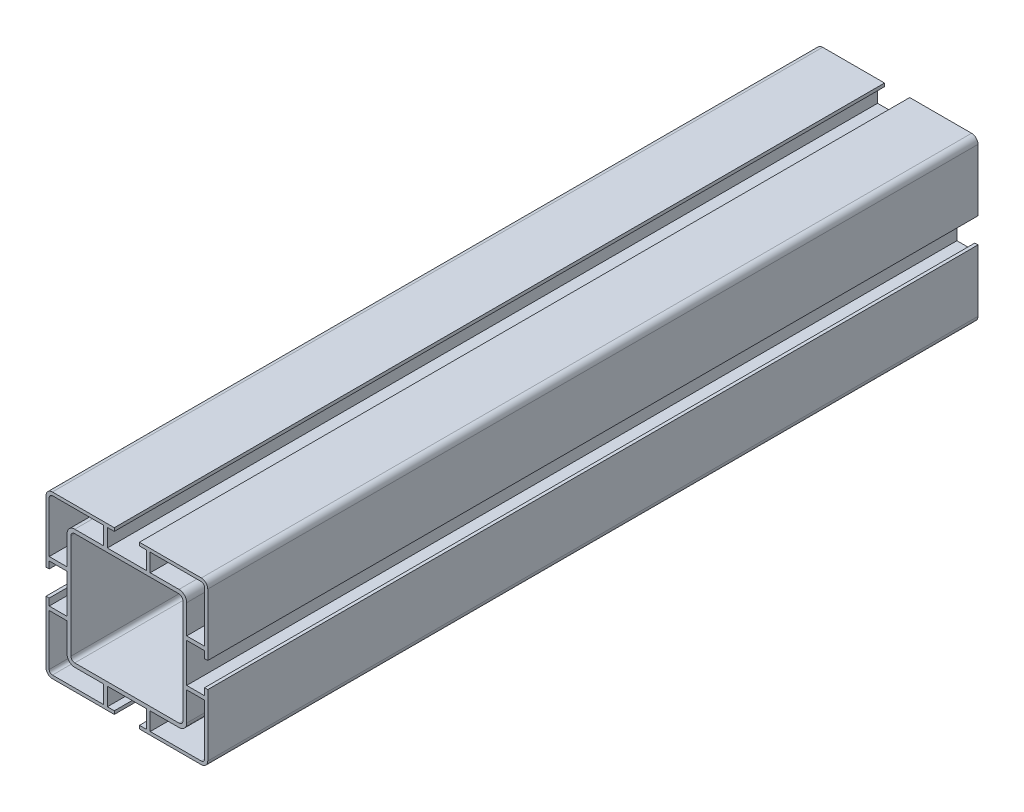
ISO-10303-21;
HEADER;
FILE_DESCRIPTION(('STEP AP214'),'2;1');
FILE_NAME('part.step','',(''),(''),'','','');
FILE_SCHEMA(('AUTOMOTIVE_DESIGN { 1 0 10303 214 1 1 1 1 }'));
ENDSEC;
DATA;
#1=APPLICATION_CONTEXT('core data for automotive mechanical design processes');
#2=APPLICATION_PROTOCOL_DEFINITION('international standard','automotive_design',2000,#1);
#3=PRODUCT_CONTEXT('',#1,'mechanical');
#4=PRODUCT('Part','Part','',(#3));
#5=PRODUCT_RELATED_PRODUCT_CATEGORY('part','',(#4));
#6=PRODUCT_DEFINITION_FORMATION('','',#4);
#7=PRODUCT_DEFINITION_CONTEXT('part definition',#1,'design');
#8=PRODUCT_DEFINITION('design','',#6,#7);
#9=PRODUCT_DEFINITION_SHAPE('','',#8);
#10=(LENGTH_UNIT() NAMED_UNIT(*) SI_UNIT(.MILLI.,.METRE.));
#11=(NAMED_UNIT(*) PLANE_ANGLE_UNIT() SI_UNIT($,.RADIAN.));
#12=(NAMED_UNIT(*) SI_UNIT($,.STERADIAN.) SOLID_ANGLE_UNIT());
#13=UNCERTAINTY_MEASURE_WITH_UNIT(LENGTH_MEASURE(1.E-05),#10,'distance_accuracy_value','');
#14=(GEOMETRIC_REPRESENTATION_CONTEXT(3) GLOBAL_UNCERTAINTY_ASSIGNED_CONTEXT((#13)) GLOBAL_UNIT_ASSIGNED_CONTEXT((#10,
#11,#12)) REPRESENTATION_CONTEXT('',''));
#15=CARTESIAN_POINT('',(0.,0.,0.));
#16=DIRECTION('',(0.,0.,1.));
#17=DIRECTION('',(1.,0.,0.));
#18=AXIS2_PLACEMENT_3D('',#15,#16,#17);
#19=CARTESIAN_POINT('',(4925.55547027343,301.506589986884,300.));
#20=DIRECTION('',(0.,0.,1.));
#21=DIRECTION('',(1.,0.,0.));
#22=AXIS2_PLACEMENT_3D('',#19,#20,#21);
#23=PLANE('',#22);
#24=DIRECTION('',(1.,0.,0.));
#25=VECTOR('',#24,1.);
#26=CARTESIAN_POINT('',(4945.45547027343,295.806589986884,300.));
#27=LINE('',#26,#25);
#28=CARTESIAN_POINT('',(4934.25547027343,295.806589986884,300.));
#29=VERTEX_POINT('',#28);
#30=CARTESIAN_POINT('',(4945.45547027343,295.806589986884,300.));
#31=VERTEX_POINT('',#30);
#32=EDGE_CURVE('E599',#29,#31,#27,.T.);
#33=ORIENTED_EDGE('',*,*,#32,.F.);
#34=CARTESIAN_POINT('',(4934.25547027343,292.806589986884,300.));
#35=DIRECTION('',(0.,0.,-1.));
#36=DIRECTION('',(1.,0.,0.));
#37=AXIS2_PLACEMENT_3D('',#34,#35,#36);
#38=CIRCLE('',#37,3.00000000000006);
#39=CARTESIAN_POINT('',(4931.25547027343,292.806589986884,300.));
#40=VERTEX_POINT('',#39);
#41=EDGE_CURVE('E597',#40,#29,#38,.T.);
#42=ORIENTED_EDGE('',*,*,#41,.F.);
#43=DIRECTION('',(0.,1.,0.));
#44=VECTOR('',#43,1.);
#45=CARTESIAN_POINT('',(4931.25547027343,292.806589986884,300.));
#46=LINE('',#45,#44);
#47=CARTESIAN_POINT('',(4931.25547027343,281.606589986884,300.));
#48=VERTEX_POINT('',#47);
#49=EDGE_CURVE('E613',#48,#40,#46,.T.);
#50=ORIENTED_EDGE('',*,*,#49,.F.);
#51=DIRECTION('',(1.,0.,0.));
#52=VECTOR('',#51,1.);
#53=CARTESIAN_POINT('',(4931.25547027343,281.606589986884,300.));
#54=LINE('',#53,#52);
#55=CARTESIAN_POINT('',(4924.30547027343,281.606589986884,300.));
#56=VERTEX_POINT('',#55);
#57=EDGE_CURVE('E610',#56,#48,#54,.T.);
#58=ORIENTED_EDGE('',*,*,#57,.F.);
#59=DIRECTION('',(0.,-1.,0.));
#60=VECTOR('',#59,1.);
#61=CARTESIAN_POINT('',(4924.30547027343,281.606589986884,300.));
#62=LINE('',#61,#60);
#63=CARTESIAN_POINT('',(4924.30547027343,301.506589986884,300.));
#64=VERTEX_POINT('',#63);
#65=EDGE_CURVE('E608',#64,#56,#62,.T.);
#66=ORIENTED_EDGE('',*,*,#65,.F.);
#67=CARTESIAN_POINT('',(4925.55547027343,301.506589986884,300.));
#68=DIRECTION('',(0.,0.,1.));
#69=DIRECTION('',(1.,0.,0.));
#70=AXIS2_PLACEMENT_3D('',#67,#68,#69);
#71=CIRCLE('',#70,1.25000000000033);
#72=CARTESIAN_POINT('',(4925.55547027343,302.756589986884,300.));
#73=VERTEX_POINT('',#72);
#74=EDGE_CURVE('E606',#73,#64,#71,.T.);
#75=ORIENTED_EDGE('',*,*,#74,.F.);
#76=DIRECTION('',(-1.,0.,0.));
#77=VECTOR('',#76,1.);
#78=CARTESIAN_POINT('',(4925.55547027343,302.756589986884,300.));
#79=LINE('',#78,#77);
#80=CARTESIAN_POINT('',(4945.45547027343,302.756589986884,300.));
#81=VERTEX_POINT('',#80);
#82=EDGE_CURVE('E604',#81,#73,#79,.T.);
#83=ORIENTED_EDGE('',*,*,#82,.F.);
#84=DIRECTION('',(0.,1.,0.));
#85=VECTOR('',#84,1.);
#86=CARTESIAN_POINT('',(4945.45547027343,302.756589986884,300.));
#87=LINE('',#86,#85);
#88=EDGE_CURVE('E602',#31,#81,#87,.T.);
#89=ORIENTED_EDGE('',*,*,#88,.F.);
#90=EDGE_LOOP('',(#33,#42,#50,#58,#66,#75,#83,#89));
#91=FACE_BOUND('',#90,.T.);
#92=DIRECTION('',(0.,-1.,0.));
#93=VECTOR('',#92,1.);
#94=CARTESIAN_POINT('',(4977.85547027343,281.606589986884,300.));
#95=LINE('',#94,#93);
#96=CARTESIAN_POINT('',(4977.85547027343,292.806589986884,300.));
#97=VERTEX_POINT('',#96);
#98=CARTESIAN_POINT('',(4977.85547027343,281.606589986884,300.));
#99=VERTEX_POINT('',#98);
#100=EDGE_CURVE('E717',#97,#99,#95,.T.);
#101=ORIENTED_EDGE('',*,*,#100,.F.);
#102=CARTESIAN_POINT('',(4974.85547027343,292.806589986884,300.));
#103=DIRECTION('',(0.,0.,-1.));
#104=DIRECTION('',(1.,0.,0.));
#105=AXIS2_PLACEMENT_3D('',#102,#103,#104);
#106=CIRCLE('',#105,3.00000000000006);
#107=CARTESIAN_POINT('',(4974.85547027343,295.806589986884,300.));
#108=VERTEX_POINT('',#107);
#109=EDGE_CURVE('E715',#108,#97,#106,.T.);
#110=ORIENTED_EDGE('',*,*,#109,.F.);
#111=DIRECTION('',(1.,0.,0.));
#112=VECTOR('',#111,1.);
#113=CARTESIAN_POINT('',(4974.85547027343,295.806589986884,300.));
#114=LINE('',#113,#112);
#115=CARTESIAN_POINT('',(4963.65547027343,295.806589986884,300.));
#116=VERTEX_POINT('',#115);
#117=EDGE_CURVE('E731',#116,#108,#114,.T.);
#118=ORIENTED_EDGE('',*,*,#117,.F.);
#119=DIRECTION('',(0.,-1.,0.));
#120=VECTOR('',#119,1.);
#121=CARTESIAN_POINT('',(4963.65547027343,295.806589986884,300.));
#122=LINE('',#121,#120);
#123=CARTESIAN_POINT('',(4963.65547027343,302.756589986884,300.));
#124=VERTEX_POINT('',#123);
#125=EDGE_CURVE('E728',#124,#116,#122,.T.);
#126=ORIENTED_EDGE('',*,*,#125,.F.);
#127=DIRECTION('',(-1.,0.,0.));
#128=VECTOR('',#127,1.);
#129=CARTESIAN_POINT('',(4963.65547027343,302.756589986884,300.));
#130=LINE('',#129,#128);
#131=CARTESIAN_POINT('',(4983.55547027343,302.756589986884,300.));
#132=VERTEX_POINT('',#131);
#133=EDGE_CURVE('E726',#132,#124,#130,.T.);
#134=ORIENTED_EDGE('',*,*,#133,.F.);
#135=CARTESIAN_POINT('',(4983.55547027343,301.506589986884,300.));
#136=DIRECTION('',(0.,0.,1.));
#137=DIRECTION('',(1.,0.,0.));
#138=AXIS2_PLACEMENT_3D('',#135,#136,#137);
#139=CIRCLE('',#138,1.24999999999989);
#140=CARTESIAN_POINT('',(4984.80547027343,301.506589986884,300.));
#141=VERTEX_POINT('',#140);
#142=EDGE_CURVE('E724',#141,#132,#139,.T.);
#143=ORIENTED_EDGE('',*,*,#142,.F.);
#144=DIRECTION('',(0.,1.,0.));
#145=VECTOR('',#144,1.);
#146=CARTESIAN_POINT('',(4984.80547027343,301.506589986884,300.));
#147=LINE('',#146,#145);
#148=CARTESIAN_POINT('',(4984.80547027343,281.606589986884,300.));
#149=VERTEX_POINT('',#148);
#150=EDGE_CURVE('E722',#149,#141,#147,.T.);
#151=ORIENTED_EDGE('',*,*,#150,.F.);
#152=DIRECTION('',(1.,0.,0.));
#153=VECTOR('',#152,1.);
#154=CARTESIAN_POINT('',(4984.80547027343,281.606589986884,300.));
#155=LINE('',#154,#153);
#156=EDGE_CURVE('E720',#99,#149,#155,.T.);
#157=ORIENTED_EDGE('',*,*,#156,.F.);
#158=EDGE_LOOP('',(#101,#110,#118,#126,#134,#143,#151,#157));
#159=FACE_BOUND('',#158,.T.);
#160=CARTESIAN_POINT('',(4925.55547027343,301.506589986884,300.));
#161=DIRECTION('',(0.,0.,1.));
#162=DIRECTION('',(1.,0.,0.));
#163=AXIS2_PLACEMENT_3D('',#160,#161,#162);
#164=CIRCLE('',#163,2.5000000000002);
#165=CARTESIAN_POINT('',(4925.55547027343,304.006589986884,300.));
#166=VERTEX_POINT('',#165);
#167=CARTESIAN_POINT('',(4923.05547027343,301.506589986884,300.));
#168=VERTEX_POINT('',#167);
#169=EDGE_CURVE('E833',#166,#168,#164,.T.);
#170=ORIENTED_EDGE('',*,*,#169,.T.);
#171=DIRECTION('',(0.,-1.,0.));
#172=VECTOR('',#171,1.);
#173=CARTESIAN_POINT('',(4923.05547027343,277.406589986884,300.));
#174=LINE('',#173,#172);
#175=CARTESIAN_POINT('',(4923.05547027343,277.406589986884,300.));
#176=VERTEX_POINT('',#175);
#177=EDGE_CURVE('E836',#168,#176,#174,.T.);
#178=ORIENTED_EDGE('',*,*,#177,.T.);
#179=DIRECTION('',(1.,0.,0.));
#180=VECTOR('',#179,1.);
#181=CARTESIAN_POINT('',(4923.05547027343,277.406589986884,300.));
#182=LINE('',#181,#180);
#183=CARTESIAN_POINT('',(4924.30547027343,277.406589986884,300.));
#184=VERTEX_POINT('',#183);
#185=EDGE_CURVE('E839',#176,#184,#182,.T.);
#186=ORIENTED_EDGE('',*,*,#185,.T.);
#187=DIRECTION('',(0.,1.,0.));
#188=VECTOR('',#187,1.);
#189=CARTESIAN_POINT('',(4924.30547027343,277.406589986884,300.));
#190=LINE('',#189,#188);
#191=CARTESIAN_POINT('',(4924.30547027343,280.106589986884,300.));
#192=VERTEX_POINT('',#191);
#193=EDGE_CURVE('E841',#184,#192,#190,.T.);
#194=ORIENTED_EDGE('',*,*,#193,.T.);
#195=DIRECTION('',(1.,0.,0.));
#196=VECTOR('',#195,1.);
#197=CARTESIAN_POINT('',(4931.25547027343,280.106589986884,300.));
#198=LINE('',#197,#196);
#199=CARTESIAN_POINT('',(4931.25547027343,280.106589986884,300.));
#200=VERTEX_POINT('',#199);
#201=EDGE_CURVE('E843',#192,#200,#198,.T.);
#202=ORIENTED_EDGE('',*,*,#201,.T.);
#203=DIRECTION('',(0.,-1.,0.));
#204=VECTOR('',#203,1.);
#205=CARTESIAN_POINT('',(4931.25547027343,264.906589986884,300.));
#206=LINE('',#205,#204);
#207=CARTESIAN_POINT('',(4931.25547027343,264.906589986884,300.));
#208=VERTEX_POINT('',#207);
#209=EDGE_CURVE('E845',#200,#208,#206,.T.);
#210=ORIENTED_EDGE('',*,*,#209,.T.);
#211=DIRECTION('',(-1.,0.,0.));
#212=VECTOR('',#211,1.);
#213=CARTESIAN_POINT('',(4931.25547027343,264.906589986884,300.));
#214=LINE('',#213,#212);
#215=CARTESIAN_POINT('',(4924.30547027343,264.906589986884,300.));
#216=VERTEX_POINT('',#215);
#217=EDGE_CURVE('E847',#208,#216,#214,.T.);
#218=ORIENTED_EDGE('',*,*,#217,.T.);
#219=DIRECTION('',(0.,1.,0.));
#220=VECTOR('',#219,1.);
#221=CARTESIAN_POINT('',(4924.30547027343,267.606589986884,300.));
#222=LINE('',#221,#220);
#223=CARTESIAN_POINT('',(4924.30547027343,267.606589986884,300.));
#224=VERTEX_POINT('',#223);
#225=EDGE_CURVE('E849',#216,#224,#222,.T.);
#226=ORIENTED_EDGE('',*,*,#225,.T.);
#227=DIRECTION('',(-1.,0.,0.));
#228=VECTOR('',#227,1.);
#229=CARTESIAN_POINT('',(4923.05547027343,267.606589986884,300.));
#230=LINE('',#229,#228);
#231=CARTESIAN_POINT('',(4923.05547027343,267.606589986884,300.));
#232=VERTEX_POINT('',#231);
#233=EDGE_CURVE('E851',#224,#232,#230,.T.);
#234=ORIENTED_EDGE('',*,*,#233,.T.);
#235=DIRECTION('',(0.,-1.,0.));
#236=VECTOR('',#235,1.);
#237=CARTESIAN_POINT('',(4923.05547027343,267.606589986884,300.));
#238=LINE('',#237,#236);
#239=CARTESIAN_POINT('',(4923.05547027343,243.506589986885,300.));
#240=VERTEX_POINT('',#239);
#241=EDGE_CURVE('E853',#232,#240,#238,.T.);
#242=ORIENTED_EDGE('',*,*,#241,.T.);
#243=CARTESIAN_POINT('',(4925.55547027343,243.506589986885,300.));
#244=DIRECTION('',(0.,0.,1.));
#245=DIRECTION('',(1.,0.,0.));
#246=AXIS2_PLACEMENT_3D('',#243,#244,#245);
#247=CIRCLE('',#246,2.5000000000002);
#248=CARTESIAN_POINT('',(4925.55547027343,241.006589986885,300.));
#249=VERTEX_POINT('',#248);
#250=EDGE_CURVE('E855',#240,#249,#247,.T.);
#251=ORIENTED_EDGE('',*,*,#250,.T.);
#252=DIRECTION('',(1.,0.,0.));
#253=VECTOR('',#252,1.);
#254=CARTESIAN_POINT('',(4949.65547027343,241.006589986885,300.));
#255=LINE('',#254,#253);
#256=CARTESIAN_POINT('',(4949.65547027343,241.006589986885,300.));
#257=VERTEX_POINT('',#256);
#258=EDGE_CURVE('E857',#249,#257,#255,.T.);
#259=ORIENTED_EDGE('',*,*,#258,.T.);
#260=DIRECTION('',(0.,1.,0.));
#261=VECTOR('',#260,1.);
#262=CARTESIAN_POINT('',(4949.65547027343,241.006589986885,300.));
#263=LINE('',#262,#261);
#264=CARTESIAN_POINT('',(4949.65547027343,242.256589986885,300.));
#265=VERTEX_POINT('',#264);
#266=EDGE_CURVE('E859',#257,#265,#263,.T.);
#267=ORIENTED_EDGE('',*,*,#266,.T.);
#268=DIRECTION('',(-1.,0.,0.));
#269=VECTOR('',#268,1.);
#270=CARTESIAN_POINT('',(4949.65547027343,242.256589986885,300.));
#271=LINE('',#270,#269);
#272=CARTESIAN_POINT('',(4946.95547027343,242.256589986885,300.));
#273=VERTEX_POINT('',#272);
#274=EDGE_CURVE('E861',#265,#273,#271,.T.);
#275=ORIENTED_EDGE('',*,*,#274,.T.);
#276=DIRECTION('',(0.,1.,0.));
#277=VECTOR('',#276,1.);
#278=CARTESIAN_POINT('',(4946.95547027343,249.206589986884,300.));
#279=LINE('',#278,#277);
#280=CARTESIAN_POINT('',(4946.95547027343,249.206589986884,300.));
#281=VERTEX_POINT('',#280);
#282=EDGE_CURVE('E863',#273,#281,#279,.T.);
#283=ORIENTED_EDGE('',*,*,#282,.T.);
#284=DIRECTION('',(1.,0.,0.));
#285=VECTOR('',#284,1.);
#286=CARTESIAN_POINT('',(4962.15547027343,249.206589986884,300.));
#287=LINE('',#286,#285);
#288=CARTESIAN_POINT('',(4962.15547027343,249.206589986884,300.));
#289=VERTEX_POINT('',#288);
#290=EDGE_CURVE('E865',#281,#289,#287,.T.);
#291=ORIENTED_EDGE('',*,*,#290,.T.);
#292=DIRECTION('',(0.,-1.,0.));
#293=VECTOR('',#292,1.);
#294=CARTESIAN_POINT('',(4962.15547027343,249.206589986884,300.));
#295=LINE('',#294,#293);
#296=CARTESIAN_POINT('',(4962.15547027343,242.256589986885,300.));
#297=VERTEX_POINT('',#296);
#298=EDGE_CURVE('E867',#289,#297,#295,.T.);
#299=ORIENTED_EDGE('',*,*,#298,.T.);
#300=DIRECTION('',(-1.,0.,0.));
#301=VECTOR('',#300,1.);
#302=CARTESIAN_POINT('',(4959.45547027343,242.256589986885,300.));
#303=LINE('',#302,#301);
#304=CARTESIAN_POINT('',(4959.45547027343,242.256589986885,300.));
#305=VERTEX_POINT('',#304);
#306=EDGE_CURVE('E869',#297,#305,#303,.T.);
#307=ORIENTED_EDGE('',*,*,#306,.T.);
#308=DIRECTION('',(0.,-1.,0.));
#309=VECTOR('',#308,1.);
#310=CARTESIAN_POINT('',(4959.45547027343,241.006589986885,300.));
#311=LINE('',#310,#309);
#312=CARTESIAN_POINT('',(4959.45547027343,241.006589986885,300.));
#313=VERTEX_POINT('',#312);
#314=EDGE_CURVE('E871',#305,#313,#311,.T.);
#315=ORIENTED_EDGE('',*,*,#314,.T.);
#316=DIRECTION('',(1.,0.,0.));
#317=VECTOR('',#316,1.);
#318=CARTESIAN_POINT('',(4959.45547027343,241.006589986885,300.));
#319=LINE('',#318,#317);
#320=CARTESIAN_POINT('',(4983.55547027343,241.006589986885,300.));
#321=VERTEX_POINT('',#320);
#322=EDGE_CURVE('E873',#313,#321,#319,.T.);
#323=ORIENTED_EDGE('',*,*,#322,.T.);
#324=CARTESIAN_POINT('',(4983.55547027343,243.506589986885,300.));
#325=DIRECTION('',(0.,0.,1.));
#326=DIRECTION('',(1.,0.,0.));
#327=AXIS2_PLACEMENT_3D('',#324,#325,#326);
#328=CIRCLE('',#327,2.49999999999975);
#329=CARTESIAN_POINT('',(4986.05547027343,243.506589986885,300.));
#330=VERTEX_POINT('',#329);
#331=EDGE_CURVE('E875',#321,#330,#328,.T.);
#332=ORIENTED_EDGE('',*,*,#331,.T.);
#333=DIRECTION('',(0.,1.,0.));
#334=VECTOR('',#333,1.);
#335=CARTESIAN_POINT('',(4986.05547027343,267.606589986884,300.));
#336=LINE('',#335,#334);
#337=CARTESIAN_POINT('',(4986.05547027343,267.606589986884,300.));
#338=VERTEX_POINT('',#337);
#339=EDGE_CURVE('E877',#330,#338,#336,.T.);
#340=ORIENTED_EDGE('',*,*,#339,.T.);
#341=DIRECTION('',(-1.,0.,0.));
#342=VECTOR('',#341,1.);
#343=CARTESIAN_POINT('',(4986.05547027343,267.606589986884,300.));
#344=LINE('',#343,#342);
#345=CARTESIAN_POINT('',(4984.80547027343,267.606589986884,300.));
#346=VERTEX_POINT('',#345);
#347=EDGE_CURVE('E879',#338,#346,#344,.T.);
#348=ORIENTED_EDGE('',*,*,#347,.T.);
#349=DIRECTION('',(0.,-1.,0.));
#350=VECTOR('',#349,1.);
#351=CARTESIAN_POINT('',(4984.80547027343,267.606589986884,300.));
#352=LINE('',#351,#350);
#353=CARTESIAN_POINT('',(4984.80547027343,264.906589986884,300.));
#354=VERTEX_POINT('',#353);
#355=EDGE_CURVE('E881',#346,#354,#352,.T.);
#356=ORIENTED_EDGE('',*,*,#355,.T.);
#357=DIRECTION('',(-1.,0.,0.));
#358=VECTOR('',#357,1.);
#359=CARTESIAN_POINT('',(4977.85547027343,264.906589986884,300.));
#360=LINE('',#359,#358);
#361=CARTESIAN_POINT('',(4977.85547027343,264.906589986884,300.));
#362=VERTEX_POINT('',#361);
#363=EDGE_CURVE('E883',#354,#362,#360,.T.);
#364=ORIENTED_EDGE('',*,*,#363,.T.);
#365=DIRECTION('',(0.,1.,0.));
#366=VECTOR('',#365,1.);
#367=CARTESIAN_POINT('',(4977.85547027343,280.106589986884,300.));
#368=LINE('',#367,#366);
#369=CARTESIAN_POINT('',(4977.85547027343,280.106589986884,300.));
#370=VERTEX_POINT('',#369);
#371=EDGE_CURVE('E885',#362,#370,#368,.T.);
#372=ORIENTED_EDGE('',*,*,#371,.T.);
#373=DIRECTION('',(1.,0.,0.));
#374=VECTOR('',#373,1.);
#375=CARTESIAN_POINT('',(4977.85547027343,280.106589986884,300.));
#376=LINE('',#375,#374);
#377=CARTESIAN_POINT('',(4984.80547027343,280.106589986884,300.));
#378=VERTEX_POINT('',#377);
#379=EDGE_CURVE('E887',#370,#378,#376,.T.);
#380=ORIENTED_EDGE('',*,*,#379,.T.);
#381=DIRECTION('',(0.,-1.,0.));
#382=VECTOR('',#381,1.);
#383=CARTESIAN_POINT('',(4984.80547027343,277.406589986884,300.));
#384=LINE('',#383,#382);
#385=CARTESIAN_POINT('',(4984.80547027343,277.406589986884,300.));
#386=VERTEX_POINT('',#385);
#387=EDGE_CURVE('E889',#378,#386,#384,.T.);
#388=ORIENTED_EDGE('',*,*,#387,.T.);
#389=DIRECTION('',(1.,0.,0.));
#390=VECTOR('',#389,1.);
#391=CARTESIAN_POINT('',(4986.05547027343,277.406589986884,300.));
#392=LINE('',#391,#390);
#393=CARTESIAN_POINT('',(4986.05547027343,277.406589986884,300.));
#394=VERTEX_POINT('',#393);
#395=EDGE_CURVE('E891',#386,#394,#392,.T.);
#396=ORIENTED_EDGE('',*,*,#395,.T.);
#397=DIRECTION('',(0.,1.,0.));
#398=VECTOR('',#397,1.);
#399=CARTESIAN_POINT('',(4986.05547027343,277.406589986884,300.));
#400=LINE('',#399,#398);
#401=CARTESIAN_POINT('',(4986.05547027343,301.506589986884,300.));
#402=VERTEX_POINT('',#401);
#403=EDGE_CURVE('E893',#394,#402,#400,.T.);
#404=ORIENTED_EDGE('',*,*,#403,.T.);
#405=CARTESIAN_POINT('',(4983.55547027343,301.506589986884,300.));
#406=DIRECTION('',(0.,0.,1.));
#407=DIRECTION('',(1.,0.,0.));
#408=AXIS2_PLACEMENT_3D('',#405,#406,#407);
#409=CIRCLE('',#408,2.49999999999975);
#410=CARTESIAN_POINT('',(4983.55547027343,304.006589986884,300.));
#411=VERTEX_POINT('',#410);
#412=EDGE_CURVE('E895',#402,#411,#409,.T.);
#413=ORIENTED_EDGE('',*,*,#412,.T.);
#414=DIRECTION('',(-1.,0.,0.));
#415=VECTOR('',#414,1.);
#416=CARTESIAN_POINT('',(4959.45547027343,304.006589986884,300.));
#417=LINE('',#416,#415);
#418=CARTESIAN_POINT('',(4959.45547027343,304.006589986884,300.));
#419=VERTEX_POINT('',#418);
#420=EDGE_CURVE('E897',#411,#419,#417,.T.);
#421=ORIENTED_EDGE('',*,*,#420,.T.);
#422=DIRECTION('',(0.,-1.,0.));
#423=VECTOR('',#422,1.);
#424=CARTESIAN_POINT('',(4959.45547027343,304.006589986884,300.));
#425=LINE('',#424,#423);
#426=CARTESIAN_POINT('',(4959.45547027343,302.756589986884,300.));
#427=VERTEX_POINT('',#426);
#428=EDGE_CURVE('E899',#419,#427,#425,.T.);
#429=ORIENTED_EDGE('',*,*,#428,.T.);
#430=DIRECTION('',(1.,0.,0.));
#431=VECTOR('',#430,1.);
#432=CARTESIAN_POINT('',(4959.45547027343,302.756589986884,300.));
#433=LINE('',#432,#431);
#434=CARTESIAN_POINT('',(4962.15547027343,302.756589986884,300.));
#435=VERTEX_POINT('',#434);
#436=EDGE_CURVE('E901',#427,#435,#433,.T.);
#437=ORIENTED_EDGE('',*,*,#436,.T.);
#438=DIRECTION('',(0.,-1.,0.));
#439=VECTOR('',#438,1.);
#440=CARTESIAN_POINT('',(4962.15547027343,295.806589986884,300.));
#441=LINE('',#440,#439);
#442=CARTESIAN_POINT('',(4962.15547027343,295.806589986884,300.));
#443=VERTEX_POINT('',#442);
#444=EDGE_CURVE('E903',#435,#443,#441,.T.);
#445=ORIENTED_EDGE('',*,*,#444,.T.);
#446=DIRECTION('',(-1.,0.,0.));
#447=VECTOR('',#446,1.);
#448=CARTESIAN_POINT('',(4962.15547027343,295.806589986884,300.));
#449=LINE('',#448,#447);
#450=CARTESIAN_POINT('',(4946.95547027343,295.806589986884,300.));
#451=VERTEX_POINT('',#450);
#452=EDGE_CURVE('E905',#443,#451,#449,.T.);
#453=ORIENTED_EDGE('',*,*,#452,.T.);
#454=DIRECTION('',(0.,1.,0.));
#455=VECTOR('',#454,1.);
#456=CARTESIAN_POINT('',(4946.95547027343,295.806589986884,300.));
#457=LINE('',#456,#455);
#458=CARTESIAN_POINT('',(4946.95547027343,302.756589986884,300.));
#459=VERTEX_POINT('',#458);
#460=EDGE_CURVE('E907',#451,#459,#457,.T.);
#461=ORIENTED_EDGE('',*,*,#460,.T.);
#462=DIRECTION('',(1.,0.,0.));
#463=VECTOR('',#462,1.);
#464=CARTESIAN_POINT('',(4949.65547027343,302.756589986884,300.));
#465=LINE('',#464,#463);
#466=CARTESIAN_POINT('',(4949.65547027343,302.756589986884,300.));
#467=VERTEX_POINT('',#466);
#468=EDGE_CURVE('E909',#459,#467,#465,.T.);
#469=ORIENTED_EDGE('',*,*,#468,.T.);
#470=DIRECTION('',(0.,1.,0.));
#471=VECTOR('',#470,1.);
#472=CARTESIAN_POINT('',(4949.65547027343,304.006589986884,300.));
#473=LINE('',#472,#471);
#474=CARTESIAN_POINT('',(4949.65547027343,304.006589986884,300.));
#475=VERTEX_POINT('',#474);
#476=EDGE_CURVE('E911',#467,#475,#473,.T.);
#477=ORIENTED_EDGE('',*,*,#476,.T.);
#478=DIRECTION('',(-1.,0.,0.));
#479=VECTOR('',#478,1.);
#480=CARTESIAN_POINT('',(4949.65547027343,304.006589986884,300.));
#481=LINE('',#480,#479);
#482=EDGE_CURVE('E913',#475,#166,#481,.T.);
#483=ORIENTED_EDGE('',*,*,#482,.T.);
#484=EDGE_LOOP('',(#170,#178,#186,#194,#202,#210,#218,#226,#234,#242,#251,#259,#267,#275,#283,
#291,#299,#307,#315,#323,#332,#340,#348,#356,#364,#372,#380,#388,#396,#404,#413,#421,#429,#437,
#445,#453,#461,#469,#477,#483));
#485=FACE_BOUND('',#484,.T.);
#486=DIRECTION('',(0.,1.,0.));
#487=VECTOR('',#486,1.);
#488=CARTESIAN_POINT('',(4931.25547027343,263.406589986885,300.));
#489=LINE('',#488,#487);
#490=CARTESIAN_POINT('',(4931.25547027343,252.206589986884,300.));
#491=VERTEX_POINT('',#490);
#492=CARTESIAN_POINT('',(4931.25547027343,263.406589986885,300.));
#493=VERTEX_POINT('',#492);
#494=EDGE_CURVE('E776',#491,#493,#489,.T.);
#495=ORIENTED_EDGE('',*,*,#494,.F.);
#496=CARTESIAN_POINT('',(4934.25547027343,252.206589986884,300.));
#497=DIRECTION('',(0.,0.,-1.));
#498=DIRECTION('',(1.,0.,0.));
#499=AXIS2_PLACEMENT_3D('',#496,#497,#498);
#500=CIRCLE('',#499,3.00000000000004);
#501=CARTESIAN_POINT('',(4934.25547027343,249.206589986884,300.));
#502=VERTEX_POINT('',#501);
#503=EDGE_CURVE('E774',#502,#491,#500,.T.);
#504=ORIENTED_EDGE('',*,*,#503,.F.);
#505=DIRECTION('',(-1.,0.,0.));
#506=VECTOR('',#505,1.);
#507=CARTESIAN_POINT('',(4934.25547027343,249.206589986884,300.));
#508=LINE('',#507,#506);
#509=CARTESIAN_POINT('',(4945.45547027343,249.206589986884,300.));
#510=VERTEX_POINT('',#509);
#511=EDGE_CURVE('E790',#510,#502,#508,.T.);
#512=ORIENTED_EDGE('',*,*,#511,.F.);
#513=DIRECTION('',(0.,1.,0.));
#514=VECTOR('',#513,1.);
#515=CARTESIAN_POINT('',(4945.45547027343,249.206589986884,300.));
#516=LINE('',#515,#514);
#517=CARTESIAN_POINT('',(4945.45547027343,242.256589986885,300.));
#518=VERTEX_POINT('',#517);
#519=EDGE_CURVE('E787',#518,#510,#516,.T.);
#520=ORIENTED_EDGE('',*,*,#519,.F.);
#521=DIRECTION('',(1.,0.,0.));
#522=VECTOR('',#521,1.);
#523=CARTESIAN_POINT('',(4945.45547027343,242.256589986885,300.));
#524=LINE('',#523,#522);
#525=CARTESIAN_POINT('',(4925.55547027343,242.256589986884,300.));
#526=VERTEX_POINT('',#525);
#527=EDGE_CURVE('E785',#526,#518,#524,.T.);
#528=ORIENTED_EDGE('',*,*,#527,.F.);
#529=CARTESIAN_POINT('',(4925.55547027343,243.506589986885,300.));
#530=DIRECTION('',(0.,0.,1.));
#531=DIRECTION('',(1.,0.,0.));
#532=AXIS2_PLACEMENT_3D('',#529,#530,#531);
#533=CIRCLE('',#532,1.25000000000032);
#534=CARTESIAN_POINT('',(4924.30547027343,243.506589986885,300.));
#535=VERTEX_POINT('',#534);
#536=EDGE_CURVE('E783',#535,#526,#533,.T.);
#537=ORIENTED_EDGE('',*,*,#536,.F.);
#538=DIRECTION('',(0.,-1.,0.));
#539=VECTOR('',#538,1.);
#540=CARTESIAN_POINT('',(4924.30547027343,243.506589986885,300.));
#541=LINE('',#540,#539);
#542=CARTESIAN_POINT('',(4924.30547027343,263.406589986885,300.));
#543=VERTEX_POINT('',#542);
#544=EDGE_CURVE('E781',#543,#535,#541,.T.);
#545=ORIENTED_EDGE('',*,*,#544,.F.);
#546=DIRECTION('',(-1.,0.,0.));
#547=VECTOR('',#546,1.);
#548=CARTESIAN_POINT('',(4924.30547027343,263.406589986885,300.));
#549=LINE('',#548,#547);
#550=EDGE_CURVE('E779',#493,#543,#549,.T.);
#551=ORIENTED_EDGE('',*,*,#550,.F.);
#552=EDGE_LOOP('',(#495,#504,#512,#520,#528,#537,#545,#551));
#553=FACE_BOUND('',#552,.T.);
#554=DIRECTION('',(-1.,0.,0.));
#555=VECTOR('',#554,1.);
#556=CARTESIAN_POINT('',(4934.25547027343,294.306589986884,300.));
#557=LINE('',#556,#555);
#558=CARTESIAN_POINT('',(4974.85547027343,294.306589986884,300.));
#559=VERTEX_POINT('',#558);
#560=CARTESIAN_POINT('',(4934.25547027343,294.306589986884,300.));
#561=VERTEX_POINT('',#560);
#562=EDGE_CURVE('E658',#559,#561,#557,.T.);
#563=ORIENTED_EDGE('',*,*,#562,.F.);
#564=CARTESIAN_POINT('',(4974.85547027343,292.806589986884,300.));
#565=DIRECTION('',(0.,0.,1.));
#566=DIRECTION('',(1.,0.,0.));
#567=AXIS2_PLACEMENT_3D('',#564,#565,#566);
#568=CIRCLE('',#567,1.50000000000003);
#569=CARTESIAN_POINT('',(4976.35547027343,292.806589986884,300.));
#570=VERTEX_POINT('',#569);
#571=EDGE_CURVE('E656',#570,#559,#568,.T.);
#572=ORIENTED_EDGE('',*,*,#571,.F.);
#573=DIRECTION('',(0.,1.,0.));
#574=VECTOR('',#573,1.);
#575=CARTESIAN_POINT('',(4976.35547027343,292.806589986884,300.));
#576=LINE('',#575,#574);
#577=CARTESIAN_POINT('',(4976.35547027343,252.206589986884,300.));
#578=VERTEX_POINT('',#577);
#579=EDGE_CURVE('E672',#578,#570,#576,.T.);
#580=ORIENTED_EDGE('',*,*,#579,.F.);
#581=CARTESIAN_POINT('',(4974.85547027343,252.206589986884,300.));
#582=DIRECTION('',(0.,0.,1.));
#583=DIRECTION('',(1.,0.,0.));
#584=AXIS2_PLACEMENT_3D('',#581,#582,#583);
#585=CIRCLE('',#584,1.5);
#586=CARTESIAN_POINT('',(4974.85547027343,250.706589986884,300.));
#587=VERTEX_POINT('',#586);
#588=EDGE_CURVE('E669',#587,#578,#585,.T.);
#589=ORIENTED_EDGE('',*,*,#588,.F.);
#590=DIRECTION('',(1.,0.,0.));
#591=VECTOR('',#590,1.);
#592=CARTESIAN_POINT('',(4974.85547027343,250.706589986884,300.));
#593=LINE('',#592,#591);
#594=CARTESIAN_POINT('',(4934.25547027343,250.706589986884,300.));
#595=VERTEX_POINT('',#594);
#596=EDGE_CURVE('E667',#595,#587,#593,.T.);
#597=ORIENTED_EDGE('',*,*,#596,.F.);
#598=CARTESIAN_POINT('',(4934.25547027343,252.206589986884,300.));
#599=DIRECTION('',(0.,0.,1.));
#600=DIRECTION('',(1.,0.,0.));
#601=AXIS2_PLACEMENT_3D('',#598,#599,#600);
#602=CIRCLE('',#601,1.5);
#603=CARTESIAN_POINT('',(4932.75547027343,252.206589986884,300.));
#604=VERTEX_POINT('',#603);
#605=EDGE_CURVE('E665',#604,#595,#602,.T.);
#606=ORIENTED_EDGE('',*,*,#605,.F.);
#607=DIRECTION('',(0.,-1.,0.));
#608=VECTOR('',#607,1.);
#609=CARTESIAN_POINT('',(4932.75547027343,252.206589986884,300.));
#610=LINE('',#609,#608);
#611=CARTESIAN_POINT('',(4932.75547027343,292.806589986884,300.));
#612=VERTEX_POINT('',#611);
#613=EDGE_CURVE('E663',#612,#604,#610,.T.);
#614=ORIENTED_EDGE('',*,*,#613,.F.);
#615=CARTESIAN_POINT('',(4934.25547027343,292.806589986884,300.));
#616=DIRECTION('',(0.,0.,1.));
#617=DIRECTION('',(1.,0.,0.));
#618=AXIS2_PLACEMENT_3D('',#615,#616,#617);
#619=CIRCLE('',#618,1.50000000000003);
#620=EDGE_CURVE('E661',#561,#612,#619,.T.);
#621=ORIENTED_EDGE('',*,*,#620,.F.);
#622=EDGE_LOOP('',(#563,#572,#580,#589,#597,#606,#614,#621));
#623=FACE_BOUND('',#622,.T.);
#624=DIRECTION('',(-1.,0.,0.));
#625=VECTOR('',#624,1.);
#626=CARTESIAN_POINT('',(4963.65547027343,249.206589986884,300.));
#627=LINE('',#626,#625);
#628=CARTESIAN_POINT('',(4974.85547027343,249.206589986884,300.));
#629=VERTEX_POINT('',#628);
#630=CARTESIAN_POINT('',(4963.65547027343,249.206589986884,300.));
#631=VERTEX_POINT('',#630);
#632=EDGE_CURVE('E540',#629,#631,#627,.T.);
#633=ORIENTED_EDGE('',*,*,#632,.F.);
#634=CARTESIAN_POINT('',(4974.85547027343,252.206589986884,300.));
#635=DIRECTION('',(0.,0.,-1.));
#636=DIRECTION('',(1.,0.,0.));
#637=AXIS2_PLACEMENT_3D('',#634,#635,#636);
#638=CIRCLE('',#637,3.00000000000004);
#639=CARTESIAN_POINT('',(4977.85547027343,252.206589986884,300.));
#640=VERTEX_POINT('',#639);
#641=EDGE_CURVE('E532',#640,#629,#638,.T.);
#642=ORIENTED_EDGE('',*,*,#641,.F.);
#643=DIRECTION('',(0.,-1.,0.));
#644=VECTOR('',#643,1.);
#645=CARTESIAN_POINT('',(4977.85547027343,252.206589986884,300.));
#646=LINE('',#645,#644);
#647=CARTESIAN_POINT('',(4977.85547027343,263.406589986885,300.));
#648=VERTEX_POINT('',#647);
#649=EDGE_CURVE('E565',#648,#640,#646,.T.);
#650=ORIENTED_EDGE('',*,*,#649,.F.);
#651=DIRECTION('',(-1.,0.,0.));
#652=VECTOR('',#651,1.);
#653=CARTESIAN_POINT('',(4977.85547027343,263.406589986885,300.));
#654=LINE('',#653,#652);
#655=CARTESIAN_POINT('',(4984.80547027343,263.406589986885,300.));
#656=VERTEX_POINT('',#655);
#657=EDGE_CURVE('E563',#656,#648,#654,.T.);
#658=ORIENTED_EDGE('',*,*,#657,.F.);
#659=DIRECTION('',(0.,1.,0.));
#660=VECTOR('',#659,1.);
#661=CARTESIAN_POINT('',(4984.80547027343,263.406589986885,300.));
#662=LINE('',#661,#660);
#663=CARTESIAN_POINT('',(4984.80547027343,243.506589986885,300.));
#664=VERTEX_POINT('',#663);
#665=EDGE_CURVE('E561',#664,#656,#662,.T.);
#666=ORIENTED_EDGE('',*,*,#665,.F.);
#667=CARTESIAN_POINT('',(4983.55547027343,243.506589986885,300.));
#668=DIRECTION('',(0.,0.,1.));
#669=DIRECTION('',(1.,0.,0.));
#670=AXIS2_PLACEMENT_3D('',#667,#668,#669);
#671=CIRCLE('',#670,1.24999999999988);
#672=CARTESIAN_POINT('',(4983.55547027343,242.256589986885,300.));
#673=VERTEX_POINT('',#672);
#674=EDGE_CURVE('E559',#673,#664,#671,.T.);
#675=ORIENTED_EDGE('',*,*,#674,.F.);
#676=DIRECTION('',(1.,0.,0.));
#677=VECTOR('',#676,1.);
#678=CARTESIAN_POINT('',(4983.55547027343,242.256589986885,300.));
#679=LINE('',#678,#677);
#680=CARTESIAN_POINT('',(4963.65547027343,242.256589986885,300.));
#681=VERTEX_POINT('',#680);
#682=EDGE_CURVE('E555',#681,#673,#679,.T.);
#683=ORIENTED_EDGE('',*,*,#682,.F.);
#684=DIRECTION('',(0.,-1.,0.));
#685=VECTOR('',#684,1.);
#686=CARTESIAN_POINT('',(4963.65547027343,242.256589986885,300.));
#687=LINE('',#686,#685);
#688=EDGE_CURVE('E553',#631,#681,#687,.T.);
#689=ORIENTED_EDGE('',*,*,#688,.F.);
#690=EDGE_LOOP('',(#633,#642,#650,#658,#666,#675,#683,#689));
#691=FACE_BOUND('',#690,.T.);
#692=ADVANCED_FACE('F35',(#91,#159,#485,#553,#623,#691),#23,.T.);
#693=CARTESIAN_POINT('',(4925.55547027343,301.506589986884,0.));
#694=DIRECTION('',(0.,0.,1.));
#695=DIRECTION('',(1.,0.,0.));
#696=AXIS2_PLACEMENT_3D('',#693,#694,#695);
#697=PLANE('',#696);
#698=CARTESIAN_POINT('',(4934.25547027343,292.806589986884,0.));
#699=DIRECTION('',(0.,0.,-1.));
#700=DIRECTION('',(1.,0.,0.));
#701=AXIS2_PLACEMENT_3D('',#698,#699,#700);
#702=CIRCLE('',#701,3.00000000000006);
#703=CARTESIAN_POINT('',(4931.25547027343,292.806589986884,0.));
#704=VERTEX_POINT('',#703);
#705=CARTESIAN_POINT('',(4934.25547027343,295.806589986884,0.));
#706=VERTEX_POINT('',#705);
#707=EDGE_CURVE('E548',#704,#706,#702,.T.);
#708=ORIENTED_EDGE('',*,*,#707,.T.);
#709=DIRECTION('',(1.,0.,0.));
#710=VECTOR('',#709,1.);
#711=CARTESIAN_POINT('',(4945.45547027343,295.806589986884,0.));
#712=LINE('',#711,#710);
#713=CARTESIAN_POINT('',(4945.45547027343,295.806589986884,0.));
#714=VERTEX_POINT('',#713);
#715=EDGE_CURVE('E618',#706,#714,#712,.T.);
#716=ORIENTED_EDGE('',*,*,#715,.T.);
#717=DIRECTION('',(0.,1.,0.));
#718=VECTOR('',#717,1.);
#719=CARTESIAN_POINT('',(4945.45547027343,302.756589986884,0.));
#720=LINE('',#719,#718);
#721=CARTESIAN_POINT('',(4945.45547027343,302.756589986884,0.));
#722=VERTEX_POINT('',#721);
#723=EDGE_CURVE('E621',#714,#722,#720,.T.);
#724=ORIENTED_EDGE('',*,*,#723,.T.);
#725=DIRECTION('',(-1.,0.,0.));
#726=VECTOR('',#725,1.);
#727=CARTESIAN_POINT('',(4925.55547027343,302.756589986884,0.));
#728=LINE('',#727,#726);
#729=CARTESIAN_POINT('',(4925.55547027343,302.756589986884,0.));
#730=VERTEX_POINT('',#729);
#731=EDGE_CURVE('E624',#722,#730,#728,.T.);
#732=ORIENTED_EDGE('',*,*,#731,.T.);
#733=CARTESIAN_POINT('',(4925.55547027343,301.506589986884,0.));
#734=DIRECTION('',(0.,0.,1.));
#735=DIRECTION('',(1.,0.,0.));
#736=AXIS2_PLACEMENT_3D('',#733,#734,#735);
#737=CIRCLE('',#736,1.25000000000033);
#738=CARTESIAN_POINT('',(4924.30547027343,301.506589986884,0.));
#739=VERTEX_POINT('',#738);
#740=EDGE_CURVE('E627',#730,#739,#737,.T.);
#741=ORIENTED_EDGE('',*,*,#740,.T.);
#742=DIRECTION('',(0.,-1.,0.));
#743=VECTOR('',#742,1.);
#744=CARTESIAN_POINT('',(4924.30547027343,281.606589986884,0.));
#745=LINE('',#744,#743);
#746=CARTESIAN_POINT('',(4924.30547027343,281.606589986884,0.));
#747=VERTEX_POINT('',#746);
#748=EDGE_CURVE('E630',#739,#747,#745,.T.);
#749=ORIENTED_EDGE('',*,*,#748,.T.);
#750=DIRECTION('',(1.,0.,0.));
#751=VECTOR('',#750,1.);
#752=CARTESIAN_POINT('',(4931.25547027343,281.606589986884,0.));
#753=LINE('',#752,#751);
#754=CARTESIAN_POINT('',(4931.25547027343,281.606589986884,0.));
#755=VERTEX_POINT('',#754);
#756=EDGE_CURVE('E633',#747,#755,#753,.T.);
#757=ORIENTED_EDGE('',*,*,#756,.T.);
#758=DIRECTION('',(0.,1.,0.));
#759=VECTOR('',#758,1.);
#760=CARTESIAN_POINT('',(4931.25547027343,292.806589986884,0.));
#761=LINE('',#760,#759);
#762=EDGE_CURVE('E600',#755,#704,#761,.T.);
#763=ORIENTED_EDGE('',*,*,#762,.T.);
#764=EDGE_LOOP('',(#708,#716,#724,#732,#741,#749,#757,#763));
#765=FACE_BOUND('',#764,.T.);
#766=CARTESIAN_POINT('',(4974.85547027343,292.806589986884,0.));
#767=DIRECTION('',(0.,0.,-1.));
#768=DIRECTION('',(1.,0.,0.));
#769=AXIS2_PLACEMENT_3D('',#766,#767,#768);
#770=CIRCLE('',#769,3.00000000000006);
#771=CARTESIAN_POINT('',(4974.85547027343,295.806589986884,0.));
#772=VERTEX_POINT('',#771);
#773=CARTESIAN_POINT('',(4977.85547027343,292.806589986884,0.));
#774=VERTEX_POINT('',#773);
#775=EDGE_CURVE('E714',#772,#774,#770,.T.);
#776=ORIENTED_EDGE('',*,*,#775,.T.);
#777=DIRECTION('',(0.,-1.,0.));
#778=VECTOR('',#777,1.);
#779=CARTESIAN_POINT('',(4977.85547027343,281.606589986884,0.));
#780=LINE('',#779,#778);
#781=CARTESIAN_POINT('',(4977.85547027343,281.606589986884,0.));
#782=VERTEX_POINT('',#781);
#783=EDGE_CURVE('E736',#774,#782,#780,.T.);
#784=ORIENTED_EDGE('',*,*,#783,.T.);
#785=DIRECTION('',(1.,0.,0.));
#786=VECTOR('',#785,1.);
#787=CARTESIAN_POINT('',(4984.80547027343,281.606589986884,0.));
#788=LINE('',#787,#786);
#789=CARTESIAN_POINT('',(4984.80547027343,281.606589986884,0.));
#790=VERTEX_POINT('',#789);
#791=EDGE_CURVE('E739',#782,#790,#788,.T.);
#792=ORIENTED_EDGE('',*,*,#791,.T.);
#793=DIRECTION('',(0.,1.,0.));
#794=VECTOR('',#793,1.);
#795=CARTESIAN_POINT('',(4984.80547027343,301.506589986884,0.));
#796=LINE('',#795,#794);
#797=CARTESIAN_POINT('',(4984.80547027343,301.506589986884,0.));
#798=VERTEX_POINT('',#797);
#799=EDGE_CURVE('E742',#790,#798,#796,.T.);
#800=ORIENTED_EDGE('',*,*,#799,.T.);
#801=CARTESIAN_POINT('',(4983.55547027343,301.506589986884,0.));
#802=DIRECTION('',(0.,0.,1.));
#803=DIRECTION('',(1.,0.,0.));
#804=AXIS2_PLACEMENT_3D('',#801,#802,#803);
#805=CIRCLE('',#804,1.24999999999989);
#806=CARTESIAN_POINT('',(4983.55547027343,302.756589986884,0.));
#807=VERTEX_POINT('',#806);
#808=EDGE_CURVE('E745',#798,#807,#805,.T.);
#809=ORIENTED_EDGE('',*,*,#808,.T.);
#810=DIRECTION('',(-1.,0.,0.));
#811=VECTOR('',#810,1.);
#812=CARTESIAN_POINT('',(4963.65547027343,302.756589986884,0.));
#813=LINE('',#812,#811);
#814=CARTESIAN_POINT('',(4963.65547027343,302.756589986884,0.));
#815=VERTEX_POINT('',#814);
#816=EDGE_CURVE('E748',#807,#815,#813,.T.);
#817=ORIENTED_EDGE('',*,*,#816,.T.);
#818=DIRECTION('',(0.,-1.,0.));
#819=VECTOR('',#818,1.);
#820=CARTESIAN_POINT('',(4963.65547027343,295.806589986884,0.));
#821=LINE('',#820,#819);
#822=CARTESIAN_POINT('',(4963.65547027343,295.806589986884,0.));
#823=VERTEX_POINT('',#822);
#824=EDGE_CURVE('E751',#815,#823,#821,.T.);
#825=ORIENTED_EDGE('',*,*,#824,.T.);
#826=DIRECTION('',(1.,0.,0.));
#827=VECTOR('',#826,1.);
#828=CARTESIAN_POINT('',(4974.85547027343,295.806589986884,0.));
#829=LINE('',#828,#827);
#830=EDGE_CURVE('E718',#823,#772,#829,.T.);
#831=ORIENTED_EDGE('',*,*,#830,.T.);
#832=EDGE_LOOP('',(#776,#784,#792,#800,#809,#817,#825,#831));
#833=FACE_BOUND('',#832,.T.);
#834=CARTESIAN_POINT('',(4925.55547027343,301.506589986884,0.));
#835=DIRECTION('',(0.,0.,1.));
#836=DIRECTION('',(1.,0.,0.));
#837=AXIS2_PLACEMENT_3D('',#834,#835,#836);
#838=CIRCLE('',#837,2.5000000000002);
#839=CARTESIAN_POINT('',(4925.55547027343,304.006589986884,0.));
#840=VERTEX_POINT('',#839);
#841=CARTESIAN_POINT('',(4923.05547027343,301.506589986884,0.));
#842=VERTEX_POINT('',#841);
#843=EDGE_CURVE('E832',#840,#842,#838,.T.);
#844=ORIENTED_EDGE('',*,*,#843,.F.);
#845=DIRECTION('',(-1.,0.,0.));
#846=VECTOR('',#845,1.);
#847=CARTESIAN_POINT('',(4949.65547027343,304.006589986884,0.));
#848=LINE('',#847,#846);
#849=CARTESIAN_POINT('',(4949.65547027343,304.006589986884,0.));
#850=VERTEX_POINT('',#849);
#851=EDGE_CURVE('E837',#850,#840,#848,.T.);
#852=ORIENTED_EDGE('',*,*,#851,.F.);
#853=DIRECTION('',(0.,1.,0.));
#854=VECTOR('',#853,1.);
#855=CARTESIAN_POINT('',(4949.65547027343,304.006589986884,0.));
#856=LINE('',#855,#854);
#857=CARTESIAN_POINT('',(4949.65547027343,302.756589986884,0.));
#858=VERTEX_POINT('',#857);
#859=EDGE_CURVE('E992',#858,#850,#856,.T.);
#860=ORIENTED_EDGE('',*,*,#859,.F.);
#861=DIRECTION('',(1.,0.,0.));
#862=VECTOR('',#861,1.);
#863=CARTESIAN_POINT('',(4949.65547027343,302.756589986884,0.));
#864=LINE('',#863,#862);
#865=CARTESIAN_POINT('',(4946.95547027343,302.756589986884,0.));
#866=VERTEX_POINT('',#865);
#867=EDGE_CURVE('E990',#866,#858,#864,.T.);
#868=ORIENTED_EDGE('',*,*,#867,.F.);
#869=DIRECTION('',(0.,1.,0.));
#870=VECTOR('',#869,1.);
#871=CARTESIAN_POINT('',(4946.95547027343,295.806589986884,0.));
#872=LINE('',#871,#870);
#873=CARTESIAN_POINT('',(4946.95547027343,295.806589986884,0.));
#874=VERTEX_POINT('',#873);
#875=EDGE_CURVE('E988',#874,#866,#872,.T.);
#876=ORIENTED_EDGE('',*,*,#875,.F.);
#877=DIRECTION('',(-1.,0.,0.));
#878=VECTOR('',#877,1.);
#879=CARTESIAN_POINT('',(4962.15547027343,295.806589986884,0.));
#880=LINE('',#879,#878);
#881=CARTESIAN_POINT('',(4962.15547027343,295.806589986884,0.));
#882=VERTEX_POINT('',#881);
#883=EDGE_CURVE('E986',#882,#874,#880,.T.);
#884=ORIENTED_EDGE('',*,*,#883,.F.);
#885=DIRECTION('',(0.,-1.,0.));
#886=VECTOR('',#885,1.);
#887=CARTESIAN_POINT('',(4962.15547027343,295.806589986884,0.));
#888=LINE('',#887,#886);
#889=CARTESIAN_POINT('',(4962.15547027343,302.756589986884,0.));
#890=VERTEX_POINT('',#889);
#891=EDGE_CURVE('E984',#890,#882,#888,.T.);
#892=ORIENTED_EDGE('',*,*,#891,.F.);
#893=DIRECTION('',(1.,0.,0.));
#894=VECTOR('',#893,1.);
#895=CARTESIAN_POINT('',(4959.45547027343,302.756589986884,0.));
#896=LINE('',#895,#894);
#897=CARTESIAN_POINT('',(4959.45547027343,302.756589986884,0.));
#898=VERTEX_POINT('',#897);
#899=EDGE_CURVE('E982',#898,#890,#896,.T.);
#900=ORIENTED_EDGE('',*,*,#899,.F.);
#901=DIRECTION('',(0.,-1.,0.));
#902=VECTOR('',#901,1.);
#903=CARTESIAN_POINT('',(4959.45547027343,304.006589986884,0.));
#904=LINE('',#903,#902);
#905=CARTESIAN_POINT('',(4959.45547027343,304.006589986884,0.));
#906=VERTEX_POINT('',#905);
#907=EDGE_CURVE('E980',#906,#898,#904,.T.);
#908=ORIENTED_EDGE('',*,*,#907,.F.);
#909=DIRECTION('',(-1.,0.,0.));
#910=VECTOR('',#909,1.);
#911=CARTESIAN_POINT('',(4959.45547027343,304.006589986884,0.));
#912=LINE('',#911,#910);
#913=CARTESIAN_POINT('',(4983.55547027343,304.006589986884,0.));
#914=VERTEX_POINT('',#913);
#915=EDGE_CURVE('E978',#914,#906,#912,.T.);
#916=ORIENTED_EDGE('',*,*,#915,.F.);
#917=CARTESIAN_POINT('',(4983.55547027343,301.506589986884,0.));
#918=DIRECTION('',(0.,0.,1.));
#919=DIRECTION('',(1.,0.,0.));
#920=AXIS2_PLACEMENT_3D('',#917,#918,#919);
#921=CIRCLE('',#920,2.49999999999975);
#922=CARTESIAN_POINT('',(4986.05547027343,301.506589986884,0.));
#923=VERTEX_POINT('',#922);
#924=EDGE_CURVE('E976',#923,#914,#921,.T.);
#925=ORIENTED_EDGE('',*,*,#924,.F.);
#926=DIRECTION('',(0.,1.,0.));
#927=VECTOR('',#926,1.);
#928=CARTESIAN_POINT('',(4986.05547027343,277.406589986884,0.));
#929=LINE('',#928,#927);
#930=CARTESIAN_POINT('',(4986.05547027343,277.406589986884,0.));
#931=VERTEX_POINT('',#930);
#932=EDGE_CURVE('E974',#931,#923,#929,.T.);
#933=ORIENTED_EDGE('',*,*,#932,.F.);
#934=DIRECTION('',(1.,0.,0.));
#935=VECTOR('',#934,1.);
#936=CARTESIAN_POINT('',(4986.05547027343,277.406589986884,0.));
#937=LINE('',#936,#935);
#938=CARTESIAN_POINT('',(4984.80547027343,277.406589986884,0.));
#939=VERTEX_POINT('',#938);
#940=EDGE_CURVE('E972',#939,#931,#937,.T.);
#941=ORIENTED_EDGE('',*,*,#940,.F.);
#942=DIRECTION('',(0.,-1.,0.));
#943=VECTOR('',#942,1.);
#944=CARTESIAN_POINT('',(4984.80547027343,277.406589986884,0.));
#945=LINE('',#944,#943);
#946=CARTESIAN_POINT('',(4984.80547027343,280.106589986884,0.));
#947=VERTEX_POINT('',#946);
#948=EDGE_CURVE('E970',#947,#939,#945,.T.);
#949=ORIENTED_EDGE('',*,*,#948,.F.);
#950=DIRECTION('',(1.,0.,0.));
#951=VECTOR('',#950,1.);
#952=CARTESIAN_POINT('',(4977.85547027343,280.106589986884,0.));
#953=LINE('',#952,#951);
#954=CARTESIAN_POINT('',(4977.85547027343,280.106589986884,0.));
#955=VERTEX_POINT('',#954);
#956=EDGE_CURVE('E968',#955,#947,#953,.T.);
#957=ORIENTED_EDGE('',*,*,#956,.F.);
#958=DIRECTION('',(0.,1.,0.));
#959=VECTOR('',#958,1.);
#960=CARTESIAN_POINT('',(4977.85547027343,280.106589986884,0.));
#961=LINE('',#960,#959);
#962=CARTESIAN_POINT('',(4977.85547027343,264.906589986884,0.));
#963=VERTEX_POINT('',#962);
#964=EDGE_CURVE('E966',#963,#955,#961,.T.);
#965=ORIENTED_EDGE('',*,*,#964,.F.);
#966=DIRECTION('',(-1.,0.,0.));
#967=VECTOR('',#966,1.);
#968=CARTESIAN_POINT('',(4977.85547027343,264.906589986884,0.));
#969=LINE('',#968,#967);
#970=CARTESIAN_POINT('',(4984.80547027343,264.906589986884,0.));
#971=VERTEX_POINT('',#970);
#972=EDGE_CURVE('E964',#971,#963,#969,.T.);
#973=ORIENTED_EDGE('',*,*,#972,.F.);
#974=DIRECTION('',(0.,-1.,0.));
#975=VECTOR('',#974,1.);
#976=CARTESIAN_POINT('',(4984.80547027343,267.606589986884,0.));
#977=LINE('',#976,#975);
#978=CARTESIAN_POINT('',(4984.80547027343,267.606589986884,0.));
#979=VERTEX_POINT('',#978);
#980=EDGE_CURVE('E962',#979,#971,#977,.T.);
#981=ORIENTED_EDGE('',*,*,#980,.F.);
#982=DIRECTION('',(-1.,0.,0.));
#983=VECTOR('',#982,1.);
#984=CARTESIAN_POINT('',(4986.05547027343,267.606589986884,0.));
#985=LINE('',#984,#983);
#986=CARTESIAN_POINT('',(4986.05547027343,267.606589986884,0.));
#987=VERTEX_POINT('',#986);
#988=EDGE_CURVE('E960',#987,#979,#985,.T.);
#989=ORIENTED_EDGE('',*,*,#988,.F.);
#990=DIRECTION('',(0.,1.,0.));
#991=VECTOR('',#990,1.);
#992=CARTESIAN_POINT('',(4986.05547027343,267.606589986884,0.));
#993=LINE('',#992,#991);
#994=CARTESIAN_POINT('',(4986.05547027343,243.506589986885,0.));
#995=VERTEX_POINT('',#994);
#996=EDGE_CURVE('E958',#995,#987,#993,.T.);
#997=ORIENTED_EDGE('',*,*,#996,.F.);
#998=CARTESIAN_POINT('',(4983.55547027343,243.506589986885,0.));
#999=DIRECTION('',(0.,0.,1.));
#1000=DIRECTION('',(1.,0.,0.));
#1001=AXIS2_PLACEMENT_3D('',#998,#999,#1000);
#1002=CIRCLE('',#1001,2.49999999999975);
#1003=CARTESIAN_POINT('',(4983.55547027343,241.006589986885,0.));
#1004=VERTEX_POINT('',#1003);
#1005=EDGE_CURVE('E956',#1004,#995,#1002,.T.);
#1006=ORIENTED_EDGE('',*,*,#1005,.F.);
#1007=DIRECTION('',(1.,0.,0.));
#1008=VECTOR('',#1007,1.);
#1009=CARTESIAN_POINT('',(4959.45547027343,241.006589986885,0.));
#1010=LINE('',#1009,#1008);
#1011=CARTESIAN_POINT('',(4959.45547027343,241.006589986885,0.));
#1012=VERTEX_POINT('',#1011);
#1013=EDGE_CURVE('E954',#1012,#1004,#1010,.T.);
#1014=ORIENTED_EDGE('',*,*,#1013,.F.);
#1015=DIRECTION('',(0.,-1.,0.));
#1016=VECTOR('',#1015,1.);
#1017=CARTESIAN_POINT('',(4959.45547027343,241.006589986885,0.));
#1018=LINE('',#1017,#1016);
#1019=CARTESIAN_POINT('',(4959.45547027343,242.256589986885,0.));
#1020=VERTEX_POINT('',#1019);
#1021=EDGE_CURVE('E952',#1020,#1012,#1018,.T.);
#1022=ORIENTED_EDGE('',*,*,#1021,.F.);
#1023=DIRECTION('',(-1.,0.,0.));
#1024=VECTOR('',#1023,1.);
#1025=CARTESIAN_POINT('',(4959.45547027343,242.256589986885,0.));
#1026=LINE('',#1025,#1024);
#1027=CARTESIAN_POINT('',(4962.15547027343,242.256589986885,0.));
#1028=VERTEX_POINT('',#1027);
#1029=EDGE_CURVE('E950',#1028,#1020,#1026,.T.);
#1030=ORIENTED_EDGE('',*,*,#1029,.F.);
#1031=DIRECTION('',(0.,-1.,0.));
#1032=VECTOR('',#1031,1.);
#1033=CARTESIAN_POINT('',(4962.15547027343,249.206589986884,0.));
#1034=LINE('',#1033,#1032);
#1035=CARTESIAN_POINT('',(4962.15547027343,249.206589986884,0.));
#1036=VERTEX_POINT('',#1035);
#1037=EDGE_CURVE('E948',#1036,#1028,#1034,.T.);
#1038=ORIENTED_EDGE('',*,*,#1037,.F.);
#1039=DIRECTION('',(1.,0.,0.));
#1040=VECTOR('',#1039,1.);
#1041=CARTESIAN_POINT('',(4962.15547027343,249.206589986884,0.));
#1042=LINE('',#1041,#1040);
#1043=CARTESIAN_POINT('',(4946.95547027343,249.206589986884,0.));
#1044=VERTEX_POINT('',#1043);
#1045=EDGE_CURVE('E946',#1044,#1036,#1042,.T.);
#1046=ORIENTED_EDGE('',*,*,#1045,.F.);
#1047=DIRECTION('',(0.,1.,0.));
#1048=VECTOR('',#1047,1.);
#1049=CARTESIAN_POINT('',(4946.95547027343,249.206589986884,0.));
#1050=LINE('',#1049,#1048);
#1051=CARTESIAN_POINT('',(4946.95547027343,242.256589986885,0.));
#1052=VERTEX_POINT('',#1051);
#1053=EDGE_CURVE('E944',#1052,#1044,#1050,.T.);
#1054=ORIENTED_EDGE('',*,*,#1053,.F.);
#1055=DIRECTION('',(-1.,0.,0.));
#1056=VECTOR('',#1055,1.);
#1057=CARTESIAN_POINT('',(4949.65547027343,242.256589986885,0.));
#1058=LINE('',#1057,#1056);
#1059=CARTESIAN_POINT('',(4949.65547027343,242.256589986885,0.));
#1060=VERTEX_POINT('',#1059);
#1061=EDGE_CURVE('E942',#1060,#1052,#1058,.T.);
#1062=ORIENTED_EDGE('',*,*,#1061,.F.);
#1063=DIRECTION('',(0.,1.,0.));
#1064=VECTOR('',#1063,1.);
#1065=CARTESIAN_POINT('',(4949.65547027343,241.006589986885,0.));
#1066=LINE('',#1065,#1064);
#1067=CARTESIAN_POINT('',(4949.65547027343,241.006589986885,0.));
#1068=VERTEX_POINT('',#1067);
#1069=EDGE_CURVE('E940',#1068,#1060,#1066,.T.);
#1070=ORIENTED_EDGE('',*,*,#1069,.F.);
#1071=DIRECTION('',(1.,0.,0.));
#1072=VECTOR('',#1071,1.);
#1073=CARTESIAN_POINT('',(4949.65547027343,241.006589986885,0.));
#1074=LINE('',#1073,#1072);
#1075=CARTESIAN_POINT('',(4925.55547027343,241.006589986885,0.));
#1076=VERTEX_POINT('',#1075);
#1077=EDGE_CURVE('E938',#1076,#1068,#1074,.T.);
#1078=ORIENTED_EDGE('',*,*,#1077,.F.);
#1079=CARTESIAN_POINT('',(4925.55547027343,243.506589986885,0.));
#1080=DIRECTION('',(0.,0.,1.));
#1081=DIRECTION('',(1.,0.,0.));
#1082=AXIS2_PLACEMENT_3D('',#1079,#1080,#1081);
#1083=CIRCLE('',#1082,2.5000000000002);
#1084=CARTESIAN_POINT('',(4923.05547027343,243.506589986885,0.));
#1085=VERTEX_POINT('',#1084);
#1086=EDGE_CURVE('E936',#1085,#1076,#1083,.T.);
#1087=ORIENTED_EDGE('',*,*,#1086,.F.);
#1088=DIRECTION('',(0.,-1.,0.));
#1089=VECTOR('',#1088,1.);
#1090=CARTESIAN_POINT('',(4923.05547027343,267.606589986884,0.));
#1091=LINE('',#1090,#1089);
#1092=CARTESIAN_POINT('',(4923.05547027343,267.606589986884,0.));
#1093=VERTEX_POINT('',#1092);
#1094=EDGE_CURVE('E934',#1093,#1085,#1091,.T.);
#1095=ORIENTED_EDGE('',*,*,#1094,.F.);
#1096=DIRECTION('',(-1.,0.,0.));
#1097=VECTOR('',#1096,1.);
#1098=CARTESIAN_POINT('',(4923.05547027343,267.606589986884,0.));
#1099=LINE('',#1098,#1097);
#1100=CARTESIAN_POINT('',(4924.30547027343,267.606589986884,0.));
#1101=VERTEX_POINT('',#1100);
#1102=EDGE_CURVE('E932',#1101,#1093,#1099,.T.);
#1103=ORIENTED_EDGE('',*,*,#1102,.F.);
#1104=DIRECTION('',(0.,1.,0.));
#1105=VECTOR('',#1104,1.);
#1106=CARTESIAN_POINT('',(4924.30547027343,267.606589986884,0.));
#1107=LINE('',#1106,#1105);
#1108=CARTESIAN_POINT('',(4924.30547027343,264.906589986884,0.));
#1109=VERTEX_POINT('',#1108);
#1110=EDGE_CURVE('E930',#1109,#1101,#1107,.T.);
#1111=ORIENTED_EDGE('',*,*,#1110,.F.);
#1112=DIRECTION('',(-1.,0.,0.));
#1113=VECTOR('',#1112,1.);
#1114=CARTESIAN_POINT('',(4931.25547027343,264.906589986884,0.));
#1115=LINE('',#1114,#1113);
#1116=CARTESIAN_POINT('',(4931.25547027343,264.906589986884,0.));
#1117=VERTEX_POINT('',#1116);
#1118=EDGE_CURVE('E928',#1117,#1109,#1115,.T.);
#1119=ORIENTED_EDGE('',*,*,#1118,.F.);
#1120=DIRECTION('',(0.,-1.,0.));
#1121=VECTOR('',#1120,1.);
#1122=CARTESIAN_POINT('',(4931.25547027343,264.906589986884,0.));
#1123=LINE('',#1122,#1121);
#1124=CARTESIAN_POINT('',(4931.25547027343,280.106589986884,0.));
#1125=VERTEX_POINT('',#1124);
#1126=EDGE_CURVE('E926',#1125,#1117,#1123,.T.);
#1127=ORIENTED_EDGE('',*,*,#1126,.F.);
#1128=DIRECTION('',(1.,0.,0.));
#1129=VECTOR('',#1128,1.);
#1130=CARTESIAN_POINT('',(4931.25547027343,280.106589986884,0.));
#1131=LINE('',#1130,#1129);
#1132=CARTESIAN_POINT('',(4924.30547027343,280.106589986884,0.));
#1133=VERTEX_POINT('',#1132);
#1134=EDGE_CURVE('E924',#1133,#1125,#1131,.T.);
#1135=ORIENTED_EDGE('',*,*,#1134,.F.);
#1136=DIRECTION('',(0.,1.,0.));
#1137=VECTOR('',#1136,1.);
#1138=CARTESIAN_POINT('',(4924.30547027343,277.406589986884,0.));
#1139=LINE('',#1138,#1137);
#1140=CARTESIAN_POINT('',(4924.30547027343,277.406589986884,0.));
#1141=VERTEX_POINT('',#1140);
#1142=EDGE_CURVE('E922',#1141,#1133,#1139,.T.);
#1143=ORIENTED_EDGE('',*,*,#1142,.F.);
#1144=DIRECTION('',(1.,0.,0.));
#1145=VECTOR('',#1144,1.);
#1146=CARTESIAN_POINT('',(4923.05547027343,277.406589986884,0.));
#1147=LINE('',#1146,#1145);
#1148=CARTESIAN_POINT('',(4923.05547027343,277.406589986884,0.));
#1149=VERTEX_POINT('',#1148);
#1150=EDGE_CURVE('E920',#1149,#1141,#1147,.T.);
#1151=ORIENTED_EDGE('',*,*,#1150,.F.);
#1152=DIRECTION('',(0.,-1.,0.));
#1153=VECTOR('',#1152,1.);
#1154=CARTESIAN_POINT('',(4923.05547027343,277.406589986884,0.));
#1155=LINE('',#1154,#1153);
#1156=EDGE_CURVE('E918',#842,#1149,#1155,.T.);
#1157=ORIENTED_EDGE('',*,*,#1156,.F.);
#1158=EDGE_LOOP('',(#844,#852,#860,#868,#876,#884,#892,#900,#908,#916,#925,#933,#941,#949,#957,
#965,#973,#981,#989,#997,#1006,#1014,#1022,#1030,#1038,#1046,#1054,#1062,#1070,#1078,#1087,
#1095,#1103,#1111,#1119,#1127,#1135,#1143,#1151,#1157));
#1159=FACE_BOUND('',#1158,.T.);
#1160=CARTESIAN_POINT('',(4934.25547027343,252.206589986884,0.));
#1161=DIRECTION('',(0.,0.,-1.));
#1162=DIRECTION('',(1.,0.,0.));
#1163=AXIS2_PLACEMENT_3D('',#1160,#1161,#1162);
#1164=CIRCLE('',#1163,3.00000000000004);
#1165=CARTESIAN_POINT('',(4934.25547027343,249.206589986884,0.));
#1166=VERTEX_POINT('',#1165);
#1167=CARTESIAN_POINT('',(4931.25547027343,252.206589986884,0.));
#1168=VERTEX_POINT('',#1167);
#1169=EDGE_CURVE('E773',#1166,#1168,#1164,.T.);
#1170=ORIENTED_EDGE('',*,*,#1169,.T.);
#1171=DIRECTION('',(0.,1.,0.));
#1172=VECTOR('',#1171,1.);
#1173=CARTESIAN_POINT('',(4931.25547027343,263.406589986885,0.));
#1174=LINE('',#1173,#1172);
#1175=CARTESIAN_POINT('',(4931.25547027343,263.406589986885,0.));
#1176=VERTEX_POINT('',#1175);
#1177=EDGE_CURVE('E795',#1168,#1176,#1174,.T.);
#1178=ORIENTED_EDGE('',*,*,#1177,.T.);
#1179=DIRECTION('',(-1.,0.,0.));
#1180=VECTOR('',#1179,1.);
#1181=CARTESIAN_POINT('',(4924.30547027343,263.406589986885,0.));
#1182=LINE('',#1181,#1180);
#1183=CARTESIAN_POINT('',(4924.30547027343,263.406589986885,0.));
#1184=VERTEX_POINT('',#1183);
#1185=EDGE_CURVE('E798',#1176,#1184,#1182,.T.);
#1186=ORIENTED_EDGE('',*,*,#1185,.T.);
#1187=DIRECTION('',(0.,-1.,0.));
#1188=VECTOR('',#1187,1.);
#1189=CARTESIAN_POINT('',(4924.30547027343,243.506589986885,0.));
#1190=LINE('',#1189,#1188);
#1191=CARTESIAN_POINT('',(4924.30547027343,243.506589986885,0.));
#1192=VERTEX_POINT('',#1191);
#1193=EDGE_CURVE('E801',#1184,#1192,#1190,.T.);
#1194=ORIENTED_EDGE('',*,*,#1193,.T.);
#1195=CARTESIAN_POINT('',(4925.55547027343,243.506589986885,0.));
#1196=DIRECTION('',(0.,0.,1.));
#1197=DIRECTION('',(1.,0.,0.));
#1198=AXIS2_PLACEMENT_3D('',#1195,#1196,#1197);
#1199=CIRCLE('',#1198,1.25000000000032);
#1200=CARTESIAN_POINT('',(4925.55547027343,242.256589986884,0.));
#1201=VERTEX_POINT('',#1200);
#1202=EDGE_CURVE('E804',#1192,#1201,#1199,.T.);
#1203=ORIENTED_EDGE('',*,*,#1202,.T.);
#1204=DIRECTION('',(1.,0.,0.));
#1205=VECTOR('',#1204,1.);
#1206=CARTESIAN_POINT('',(4945.45547027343,242.256589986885,0.));
#1207=LINE('',#1206,#1205);
#1208=CARTESIAN_POINT('',(4945.45547027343,242.256589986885,0.));
#1209=VERTEX_POINT('',#1208);
#1210=EDGE_CURVE('E807',#1201,#1209,#1207,.T.);
#1211=ORIENTED_EDGE('',*,*,#1210,.T.);
#1212=DIRECTION('',(0.,1.,0.));
#1213=VECTOR('',#1212,1.);
#1214=CARTESIAN_POINT('',(4945.45547027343,249.206589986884,0.));
#1215=LINE('',#1214,#1213);
#1216=CARTESIAN_POINT('',(4945.45547027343,249.206589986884,0.));
#1217=VERTEX_POINT('',#1216);
#1218=EDGE_CURVE('E810',#1209,#1217,#1215,.T.);
#1219=ORIENTED_EDGE('',*,*,#1218,.T.);
#1220=DIRECTION('',(-1.,0.,0.));
#1221=VECTOR('',#1220,1.);
#1222=CARTESIAN_POINT('',(4934.25547027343,249.206589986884,0.));
#1223=LINE('',#1222,#1221);
#1224=EDGE_CURVE('E777',#1217,#1166,#1223,.T.);
#1225=ORIENTED_EDGE('',*,*,#1224,.T.);
#1226=EDGE_LOOP('',(#1170,#1178,#1186,#1194,#1203,#1211,#1219,#1225));
#1227=FACE_BOUND('',#1226,.T.);
#1228=CARTESIAN_POINT('',(4974.85547027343,292.806589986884,0.));
#1229=DIRECTION('',(0.,0.,1.));
#1230=DIRECTION('',(1.,0.,0.));
#1231=AXIS2_PLACEMENT_3D('',#1228,#1229,#1230);
#1232=CIRCLE('',#1231,1.50000000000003);
#1233=CARTESIAN_POINT('',(4976.35547027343,292.806589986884,0.));
#1234=VERTEX_POINT('',#1233);
#1235=CARTESIAN_POINT('',(4974.85547027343,294.306589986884,0.));
#1236=VERTEX_POINT('',#1235);
#1237=EDGE_CURVE('E655',#1234,#1236,#1232,.T.);
#1238=ORIENTED_EDGE('',*,*,#1237,.T.);
#1239=DIRECTION('',(-1.,0.,0.));
#1240=VECTOR('',#1239,1.);
#1241=CARTESIAN_POINT('',(4934.25547027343,294.306589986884,0.));
#1242=LINE('',#1241,#1240);
#1243=CARTESIAN_POINT('',(4934.25547027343,294.306589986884,0.));
#1244=VERTEX_POINT('',#1243);
#1245=EDGE_CURVE('E677',#1236,#1244,#1242,.T.);
#1246=ORIENTED_EDGE('',*,*,#1245,.T.);
#1247=CARTESIAN_POINT('',(4934.25547027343,292.806589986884,0.));
#1248=DIRECTION('',(0.,0.,1.));
#1249=DIRECTION('',(1.,0.,0.));
#1250=AXIS2_PLACEMENT_3D('',#1247,#1248,#1249);
#1251=CIRCLE('',#1250,1.50000000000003);
#1252=CARTESIAN_POINT('',(4932.75547027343,292.806589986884,0.));
#1253=VERTEX_POINT('',#1252);
#1254=EDGE_CURVE('E680',#1244,#1253,#1251,.T.);
#1255=ORIENTED_EDGE('',*,*,#1254,.T.);
#1256=DIRECTION('',(0.,-1.,0.));
#1257=VECTOR('',#1256,1.);
#1258=CARTESIAN_POINT('',(4932.75547027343,252.206589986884,0.));
#1259=LINE('',#1258,#1257);
#1260=CARTESIAN_POINT('',(4932.75547027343,252.206589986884,0.));
#1261=VERTEX_POINT('',#1260);
#1262=EDGE_CURVE('E683',#1253,#1261,#1259,.T.);
#1263=ORIENTED_EDGE('',*,*,#1262,.T.);
#1264=CARTESIAN_POINT('',(4934.25547027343,252.206589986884,0.));
#1265=DIRECTION('',(0.,0.,1.));
#1266=DIRECTION('',(1.,0.,0.));
#1267=AXIS2_PLACEMENT_3D('',#1264,#1265,#1266);
#1268=CIRCLE('',#1267,1.5);
#1269=CARTESIAN_POINT('',(4934.25547027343,250.706589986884,0.));
#1270=VERTEX_POINT('',#1269);
#1271=EDGE_CURVE('E686',#1261,#1270,#1268,.T.);
#1272=ORIENTED_EDGE('',*,*,#1271,.T.);
#1273=DIRECTION('',(1.,0.,0.));
#1274=VECTOR('',#1273,1.);
#1275=CARTESIAN_POINT('',(4974.85547027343,250.706589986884,0.));
#1276=LINE('',#1275,#1274);
#1277=CARTESIAN_POINT('',(4974.85547027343,250.706589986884,0.));
#1278=VERTEX_POINT('',#1277);
#1279=EDGE_CURVE('E689',#1270,#1278,#1276,.T.);
#1280=ORIENTED_EDGE('',*,*,#1279,.T.);
#1281=CARTESIAN_POINT('',(4974.85547027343,252.206589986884,0.));
#1282=DIRECTION('',(0.,0.,1.));
#1283=DIRECTION('',(1.,0.,0.));
#1284=AXIS2_PLACEMENT_3D('',#1281,#1282,#1283);
#1285=CIRCLE('',#1284,1.5);
#1286=CARTESIAN_POINT('',(4976.35547027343,252.206589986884,0.));
#1287=VERTEX_POINT('',#1286);
#1288=EDGE_CURVE('E692',#1278,#1287,#1285,.T.);
#1289=ORIENTED_EDGE('',*,*,#1288,.T.);
#1290=DIRECTION('',(0.,1.,0.));
#1291=VECTOR('',#1290,1.);
#1292=CARTESIAN_POINT('',(4976.35547027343,292.806589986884,0.));
#1293=LINE('',#1292,#1291);
#1294=EDGE_CURVE('E659',#1287,#1234,#1293,.T.);
#1295=ORIENTED_EDGE('',*,*,#1294,.T.);
#1296=EDGE_LOOP('',(#1238,#1246,#1255,#1263,#1272,#1280,#1289,#1295));
#1297=FACE_BOUND('',#1296,.T.);
#1298=CARTESIAN_POINT('',(4974.85547027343,252.206589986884,0.));
#1299=DIRECTION('',(0.,0.,-1.));
#1300=DIRECTION('',(1.,0.,0.));
#1301=AXIS2_PLACEMENT_3D('',#1298,#1299,#1300);
#1302=CIRCLE('',#1301,3.00000000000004);
#1303=CARTESIAN_POINT('',(4977.85547027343,252.206589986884,0.));
#1304=VERTEX_POINT('',#1303);
#1305=CARTESIAN_POINT('',(4974.85547027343,249.206589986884,0.));
#1306=VERTEX_POINT('',#1305);
#1307=EDGE_CURVE('E58',#1304,#1306,#1302,.T.);
#1308=ORIENTED_EDGE('',*,*,#1307,.T.);
#1309=DIRECTION('',(-1.,0.,0.));
#1310=VECTOR('',#1309,1.);
#1311=CARTESIAN_POINT('',(4963.65547027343,249.206589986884,0.));
#1312=LINE('',#1311,#1310);
#1313=CARTESIAN_POINT('',(4963.65547027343,249.206589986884,0.));
#1314=VERTEX_POINT('',#1313);
#1315=EDGE_CURVE('E547',#1306,#1314,#1312,.T.);
#1316=ORIENTED_EDGE('',*,*,#1315,.T.);
#1317=DIRECTION('',(0.,-1.,0.));
#1318=VECTOR('',#1317,1.);
#1319=CARTESIAN_POINT('',(4963.65547027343,242.256589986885,0.));
#1320=LINE('',#1319,#1318);
#1321=CARTESIAN_POINT('',(4963.65547027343,242.256589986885,0.));
#1322=VERTEX_POINT('',#1321);
#1323=EDGE_CURVE('E569',#1314,#1322,#1320,.T.);
#1324=ORIENTED_EDGE('',*,*,#1323,.T.);
#1325=DIRECTION('',(1.,0.,0.));
#1326=VECTOR('',#1325,1.);
#1327=CARTESIAN_POINT('',(4983.55547027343,242.256589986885,0.));
#1328=LINE('',#1327,#1326);
#1329=CARTESIAN_POINT('',(4983.55547027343,242.256589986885,0.));
#1330=VERTEX_POINT('',#1329);
#1331=EDGE_CURVE('E572',#1322,#1330,#1328,.T.);
#1332=ORIENTED_EDGE('',*,*,#1331,.T.);
#1333=CARTESIAN_POINT('',(4983.55547027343,243.506589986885,0.));
#1334=DIRECTION('',(0.,0.,1.));
#1335=DIRECTION('',(1.,0.,0.));
#1336=AXIS2_PLACEMENT_3D('',#1333,#1334,#1335);
#1337=CIRCLE('',#1336,1.24999999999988);
#1338=CARTESIAN_POINT('',(4984.80547027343,243.506589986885,0.));
#1339=VERTEX_POINT('',#1338);
#1340=EDGE_CURVE('E575',#1330,#1339,#1337,.T.);
#1341=ORIENTED_EDGE('',*,*,#1340,.T.);
#1342=DIRECTION('',(0.,1.,0.));
#1343=VECTOR('',#1342,1.);
#1344=CARTESIAN_POINT('',(4984.80547027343,263.406589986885,0.));
#1345=LINE('',#1344,#1343);
#1346=CARTESIAN_POINT('',(4984.80547027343,263.406589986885,0.));
#1347=VERTEX_POINT('',#1346);
#1348=EDGE_CURVE('E578',#1339,#1347,#1345,.T.);
#1349=ORIENTED_EDGE('',*,*,#1348,.T.);
#1350=DIRECTION('',(-1.,0.,0.));
#1351=VECTOR('',#1350,1.);
#1352=CARTESIAN_POINT('',(4977.85547027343,263.406589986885,0.));
#1353=LINE('',#1352,#1351);
#1354=CARTESIAN_POINT('',(4977.85547027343,263.406589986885,0.));
#1355=VERTEX_POINT('',#1354);
#1356=EDGE_CURVE('E581',#1347,#1355,#1353,.T.);
#1357=ORIENTED_EDGE('',*,*,#1356,.T.);
#1358=DIRECTION('',(0.,-1.,0.));
#1359=VECTOR('',#1358,1.);
#1360=CARTESIAN_POINT('',(4977.85547027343,252.206589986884,0.));
#1361=LINE('',#1360,#1359);
#1362=EDGE_CURVE('E541',#1355,#1304,#1361,.T.);
#1363=ORIENTED_EDGE('',*,*,#1362,.T.);
#1364=EDGE_LOOP('',(#1308,#1316,#1324,#1332,#1341,#1349,#1357,#1363));
#1365=FACE_BOUND('',#1364,.T.);
#1366=ADVANCED_FACE('F1118',(#765,#833,#1159,#1227,#1297,#1365),#697,.F.);
#1367=CARTESIAN_POINT('',(4925.55547027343,301.506589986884,300.));
#1368=DIRECTION('',(0.,0.,-1.));
#1369=DIRECTION('',(-1.,0.,0.));
#1370=AXIS2_PLACEMENT_3D('',#1367,#1368,#1369);
#1371=CYLINDRICAL_SURFACE('',#1370,2.5000000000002);
#1372=ORIENTED_EDGE('',*,*,#843,.T.);
#1373=DIRECTION('',(0.,0.,-1.));
#1374=VECTOR('',#1373,1.);
#1375=CARTESIAN_POINT('',(4923.05547027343,301.506589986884,300.));
#1376=LINE('',#1375,#1374);
#1377=EDGE_CURVE('E11',#168,#842,#1376,.T.);
#1378=ORIENTED_EDGE('',*,*,#1377,.F.);
#1379=ORIENTED_EDGE('',*,*,#169,.F.);
#1380=DIRECTION('',(0.,0.,-1.));
#1381=VECTOR('',#1380,1.);
#1382=CARTESIAN_POINT('',(4925.55547027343,304.006589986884,300.));
#1383=LINE('',#1382,#1381);
#1384=EDGE_CURVE('E915',#166,#840,#1383,.T.);
#1385=ORIENTED_EDGE('',*,*,#1384,.T.);
#1386=EDGE_LOOP('',(#1372,#1378,#1379,#1385));
#1387=FACE_BOUND('',#1386,.T.);
#1388=ADVANCED_FACE('F37',(#1387),#1371,.T.);
#1389=CARTESIAN_POINT('',(4923.05547027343,277.406589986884,300.));
#1390=DIRECTION('',(1.,0.,0.));
#1391=DIRECTION('',(0.,0.,-1.));
#1392=AXIS2_PLACEMENT_3D('',#1389,#1390,#1391);
#1393=PLANE('',#1392);
#1394=ORIENTED_EDGE('',*,*,#1156,.T.);
#1395=DIRECTION('',(0.,0.,-1.));
#1396=VECTOR('',#1395,1.);
#1397=CARTESIAN_POINT('',(4923.05547027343,277.406589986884,300.));
#1398=LINE('',#1397,#1396);
#1399=EDGE_CURVE('E43',#176,#1149,#1398,.T.);
#1400=ORIENTED_EDGE('',*,*,#1399,.F.);
#1401=ORIENTED_EDGE('',*,*,#177,.F.);
#1402=ORIENTED_EDGE('',*,*,#1377,.T.);
#1403=EDGE_LOOP('',(#1394,#1400,#1401,#1402));
#1404=FACE_BOUND('',#1403,.T.);
#1405=ADVANCED_FACE('F1136',(#1404),#1393,.F.);
#1406=CARTESIAN_POINT('',(4923.05547027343,277.406589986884,300.));
#1407=DIRECTION('',(0.,1.,0.));
#1408=DIRECTION('',(0.,0.,1.));
#1409=AXIS2_PLACEMENT_3D('',#1406,#1407,#1408);
#1410=PLANE('',#1409);
#1411=ORIENTED_EDGE('',*,*,#1150,.T.);
#1412=DIRECTION('',(0.,0.,-1.));
#1413=VECTOR('',#1412,1.);
#1414=CARTESIAN_POINT('',(4924.30547027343,277.406589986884,300.));
#1415=LINE('',#1414,#1413);
#1416=EDGE_CURVE('E1105',#184,#1141,#1415,.T.);
#1417=ORIENTED_EDGE('',*,*,#1416,.F.);
#1418=ORIENTED_EDGE('',*,*,#185,.F.);
#1419=ORIENTED_EDGE('',*,*,#1399,.T.);
#1420=EDGE_LOOP('',(#1411,#1417,#1418,#1419));
#1421=FACE_BOUND('',#1420,.T.);
#1422=ADVANCED_FACE('F1112',(#1421),#1410,.F.);
#1423=CARTESIAN_POINT('',(4924.30547027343,277.406589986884,300.));
#1424=DIRECTION('',(-1.,0.,0.));
#1425=DIRECTION('',(0.,0.,1.));
#1426=AXIS2_PLACEMENT_3D('',#1423,#1424,#1425);
#1427=PLANE('',#1426);
#1428=ORIENTED_EDGE('',*,*,#1142,.T.);
#1429=DIRECTION('',(0.,0.,-1.));
#1430=VECTOR('',#1429,1.);
#1431=CARTESIAN_POINT('',(4924.30547027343,280.106589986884,300.));
#1432=LINE('',#1431,#1430);
#1433=EDGE_CURVE('E1102',#192,#1133,#1432,.T.);
#1434=ORIENTED_EDGE('',*,*,#1433,.F.);
#1435=ORIENTED_EDGE('',*,*,#193,.F.);
#1436=ORIENTED_EDGE('',*,*,#1416,.T.);
#1437=EDGE_LOOP('',(#1428,#1434,#1435,#1436));
#1438=FACE_BOUND('',#1437,.T.);
#1439=ADVANCED_FACE('F1124',(#1438),#1427,.F.);
#1440=CARTESIAN_POINT('',(4931.25547027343,280.106589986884,300.));
#1441=DIRECTION('',(0.,1.,0.));
#1442=DIRECTION('',(0.,0.,1.));
#1443=AXIS2_PLACEMENT_3D('',#1440,#1441,#1442);
#1444=PLANE('',#1443);
#1445=ORIENTED_EDGE('',*,*,#1134,.T.);
#1446=DIRECTION('',(0.,0.,-1.));
#1447=VECTOR('',#1446,1.);
#1448=CARTESIAN_POINT('',(4931.25547027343,280.106589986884,300.));
#1449=LINE('',#1448,#1447);
#1450=EDGE_CURVE('E1099',#200,#1125,#1449,.T.);
#1451=ORIENTED_EDGE('',*,*,#1450,.F.);
#1452=ORIENTED_EDGE('',*,*,#201,.F.);
#1453=ORIENTED_EDGE('',*,*,#1433,.T.);
#1454=EDGE_LOOP('',(#1445,#1451,#1452,#1453));
#1455=FACE_BOUND('',#1454,.T.);
#1456=ADVANCED_FACE('F1128',(#1455),#1444,.F.);
#1457=CARTESIAN_POINT('',(4931.25547027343,264.906589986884,300.));
#1458=DIRECTION('',(1.,0.,0.));
#1459=DIRECTION('',(0.,0.,-1.));
#1460=AXIS2_PLACEMENT_3D('',#1457,#1458,#1459);
#1461=PLANE('',#1460);
#1462=ORIENTED_EDGE('',*,*,#1126,.T.);
#1463=DIRECTION('',(0.,0.,-1.));
#1464=VECTOR('',#1463,1.);
#1465=CARTESIAN_POINT('',(4931.25547027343,264.906589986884,300.));
#1466=LINE('',#1465,#1464);
#1467=EDGE_CURVE('E1096',#208,#1117,#1466,.T.);
#1468=ORIENTED_EDGE('',*,*,#1467,.F.);
#1469=ORIENTED_EDGE('',*,*,#209,.F.);
#1470=ORIENTED_EDGE('',*,*,#1450,.T.);
#1471=EDGE_LOOP('',(#1462,#1468,#1469,#1470));
#1472=FACE_BOUND('',#1471,.T.);
#1473=ADVANCED_FACE('F1309',(#1472),#1461,.F.);
#1474=CARTESIAN_POINT('',(4931.25547027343,264.906589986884,300.));
#1475=DIRECTION('',(0.,-1.,0.));
#1476=DIRECTION('',(0.,0.,-1.));
#1477=AXIS2_PLACEMENT_3D('',#1474,#1475,#1476);
#1478=PLANE('',#1477);
#1479=ORIENTED_EDGE('',*,*,#1118,.T.);
#1480=DIRECTION('',(0.,0.,-1.));
#1481=VECTOR('',#1480,1.);
#1482=CARTESIAN_POINT('',(4924.30547027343,264.906589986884,300.));
#1483=LINE('',#1482,#1481);
#1484=EDGE_CURVE('E1093',#216,#1109,#1483,.T.);
#1485=ORIENTED_EDGE('',*,*,#1484,.F.);
#1486=ORIENTED_EDGE('',*,*,#217,.F.);
#1487=ORIENTED_EDGE('',*,*,#1467,.T.);
#1488=EDGE_LOOP('',(#1479,#1485,#1486,#1487));
#1489=FACE_BOUND('',#1488,.T.);
#1490=ADVANCED_FACE('F1306',(#1489),#1478,.F.);
#1491=CARTESIAN_POINT('',(4924.30547027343,267.606589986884,300.));
#1492=DIRECTION('',(-1.,0.,0.));
#1493=DIRECTION('',(0.,0.,1.));
#1494=AXIS2_PLACEMENT_3D('',#1491,#1492,#1493);
#1495=PLANE('',#1494);
#1496=ORIENTED_EDGE('',*,*,#1110,.T.);
#1497=DIRECTION('',(0.,0.,-1.));
#1498=VECTOR('',#1497,1.);
#1499=CARTESIAN_POINT('',(4924.30547027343,267.606589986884,300.));
#1500=LINE('',#1499,#1498);
#1501=EDGE_CURVE('E1090',#224,#1101,#1500,.T.);
#1502=ORIENTED_EDGE('',*,*,#1501,.F.);
#1503=ORIENTED_EDGE('',*,*,#225,.F.);
#1504=ORIENTED_EDGE('',*,*,#1484,.T.);
#1505=EDGE_LOOP('',(#1496,#1502,#1503,#1504));
#1506=FACE_BOUND('',#1505,.T.);
#1507=ADVANCED_FACE('F1302',(#1506),#1495,.F.);
#1508=CARTESIAN_POINT('',(4923.05547027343,267.606589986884,300.));
#1509=DIRECTION('',(0.,-1.,0.));
#1510=DIRECTION('',(0.,0.,-1.));
#1511=AXIS2_PLACEMENT_3D('',#1508,#1509,#1510);
#1512=PLANE('',#1511);
#1513=ORIENTED_EDGE('',*,*,#1102,.T.);
#1514=DIRECTION('',(0.,0.,-1.));
#1515=VECTOR('',#1514,1.);
#1516=CARTESIAN_POINT('',(4923.05547027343,267.606589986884,300.));
#1517=LINE('',#1516,#1515);
#1518=EDGE_CURVE('E1087',#232,#1093,#1517,.T.);
#1519=ORIENTED_EDGE('',*,*,#1518,.F.);
#1520=ORIENTED_EDGE('',*,*,#233,.F.);
#1521=ORIENTED_EDGE('',*,*,#1501,.T.);
#1522=EDGE_LOOP('',(#1513,#1519,#1520,#1521));
#1523=FACE_BOUND('',#1522,.T.);
#1524=ADVANCED_FACE('F1298',(#1523),#1512,.F.);
#1525=CARTESIAN_POINT('',(4923.05547027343,267.606589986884,300.));
#1526=DIRECTION('',(1.,0.,0.));
#1527=DIRECTION('',(0.,0.,-1.));
#1528=AXIS2_PLACEMENT_3D('',#1525,#1526,#1527);
#1529=PLANE('',#1528);
#1530=ORIENTED_EDGE('',*,*,#1094,.T.);
#1531=DIRECTION('',(0.,0.,-1.));
#1532=VECTOR('',#1531,1.);
#1533=CARTESIAN_POINT('',(4923.05547027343,243.506589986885,300.));
#1534=LINE('',#1533,#1532);
#1535=EDGE_CURVE('E1084',#240,#1085,#1534,.T.);
#1536=ORIENTED_EDGE('',*,*,#1535,.F.);
#1537=ORIENTED_EDGE('',*,*,#241,.F.);
#1538=ORIENTED_EDGE('',*,*,#1518,.T.);
#1539=EDGE_LOOP('',(#1530,#1536,#1537,#1538));
#1540=FACE_BOUND('',#1539,.T.);
#1541=ADVANCED_FACE('F1293',(#1540),#1529,.F.);
#1542=CARTESIAN_POINT('',(4925.55547027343,243.506589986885,300.));
#1543=DIRECTION('',(0.,0.,-1.));
#1544=DIRECTION('',(-1.,0.,0.));
#1545=AXIS2_PLACEMENT_3D('',#1542,#1543,#1544);
#1546=CYLINDRICAL_SURFACE('',#1545,2.5000000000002);
#1547=ORIENTED_EDGE('',*,*,#1086,.T.);
#1548=DIRECTION('',(0.,0.,-1.));
#1549=VECTOR('',#1548,1.);
#1550=CARTESIAN_POINT('',(4925.55547027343,241.006589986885,300.));
#1551=LINE('',#1550,#1549);
#1552=EDGE_CURVE('E1081',#249,#1076,#1551,.T.);
#1553=ORIENTED_EDGE('',*,*,#1552,.F.);
#1554=ORIENTED_EDGE('',*,*,#250,.F.);
#1555=ORIENTED_EDGE('',*,*,#1535,.T.);
#1556=EDGE_LOOP('',(#1547,#1553,#1554,#1555));
#1557=FACE_BOUND('',#1556,.T.);
#1558=ADVANCED_FACE('F1287',(#1557),#1546,.T.);
#1559=CARTESIAN_POINT('',(4949.65547027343,241.006589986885,300.));
#1560=DIRECTION('',(0.,1.,0.));
#1561=DIRECTION('',(0.,0.,1.));
#1562=AXIS2_PLACEMENT_3D('',#1559,#1560,#1561);
#1563=PLANE('',#1562);
#1564=ORIENTED_EDGE('',*,*,#1077,.T.);
#1565=DIRECTION('',(0.,0.,-1.));
#1566=VECTOR('',#1565,1.);
#1567=CARTESIAN_POINT('',(4949.65547027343,241.006589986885,300.));
#1568=LINE('',#1567,#1566);
#1569=EDGE_CURVE('E1078',#257,#1068,#1568,.T.);
#1570=ORIENTED_EDGE('',*,*,#1569,.F.);
#1571=ORIENTED_EDGE('',*,*,#258,.F.);
#1572=ORIENTED_EDGE('',*,*,#1552,.T.);
#1573=EDGE_LOOP('',(#1564,#1570,#1571,#1572));
#1574=FACE_BOUND('',#1573,.T.);
#1575=ADVANCED_FACE('F1283',(#1574),#1563,.F.);
#1576=CARTESIAN_POINT('',(4949.65547027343,241.006589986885,300.));
#1577=DIRECTION('',(-1.,0.,0.));
#1578=DIRECTION('',(0.,0.,1.));
#1579=AXIS2_PLACEMENT_3D('',#1576,#1577,#1578);
#1580=PLANE('',#1579);
#1581=ORIENTED_EDGE('',*,*,#1069,.T.);
#1582=DIRECTION('',(0.,0.,-1.));
#1583=VECTOR('',#1582,1.);
#1584=CARTESIAN_POINT('',(4949.65547027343,242.256589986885,300.));
#1585=LINE('',#1584,#1583);
#1586=EDGE_CURVE('E1075',#265,#1060,#1585,.T.);
#1587=ORIENTED_EDGE('',*,*,#1586,.F.);
#1588=ORIENTED_EDGE('',*,*,#266,.F.);
#1589=ORIENTED_EDGE('',*,*,#1569,.T.);
#1590=EDGE_LOOP('',(#1581,#1587,#1588,#1589));
#1591=FACE_BOUND('',#1590,.T.);
#1592=ADVANCED_FACE('F1278',(#1591),#1580,.F.);
#1593=CARTESIAN_POINT('',(4949.65547027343,242.256589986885,300.));
#1594=DIRECTION('',(0.,-1.,0.));
#1595=DIRECTION('',(0.,0.,-1.));
#1596=AXIS2_PLACEMENT_3D('',#1593,#1594,#1595);
#1597=PLANE('',#1596);
#1598=ORIENTED_EDGE('',*,*,#1061,.T.);
#1599=DIRECTION('',(0.,0.,-1.));
#1600=VECTOR('',#1599,1.);
#1601=CARTESIAN_POINT('',(4946.95547027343,242.256589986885,300.));
#1602=LINE('',#1601,#1600);
#1603=EDGE_CURVE('E1072',#273,#1052,#1602,.T.);
#1604=ORIENTED_EDGE('',*,*,#1603,.F.);
#1605=ORIENTED_EDGE('',*,*,#274,.F.);
#1606=ORIENTED_EDGE('',*,*,#1586,.T.);
#1607=EDGE_LOOP('',(#1598,#1604,#1605,#1606));
#1608=FACE_BOUND('',#1607,.T.);
#1609=ADVANCED_FACE('F1272',(#1608),#1597,.F.);
#1610=CARTESIAN_POINT('',(4946.95547027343,249.206589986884,300.));
#1611=DIRECTION('',(-1.,0.,0.));
#1612=DIRECTION('',(0.,0.,1.));
#1613=AXIS2_PLACEMENT_3D('',#1610,#1611,#1612);
#1614=PLANE('',#1613);
#1615=ORIENTED_EDGE('',*,*,#1053,.T.);
#1616=DIRECTION('',(0.,0.,-1.));
#1617=VECTOR('',#1616,1.);
#1618=CARTESIAN_POINT('',(4946.95547027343,249.206589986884,300.));
#1619=LINE('',#1618,#1617);
#1620=EDGE_CURVE('E1069',#281,#1044,#1619,.T.);
#1621=ORIENTED_EDGE('',*,*,#1620,.F.);
#1622=ORIENTED_EDGE('',*,*,#282,.F.);
#1623=ORIENTED_EDGE('',*,*,#1603,.T.);
#1624=EDGE_LOOP('',(#1615,#1621,#1622,#1623));
#1625=FACE_BOUND('',#1624,.T.);
#1626=ADVANCED_FACE('F1268',(#1625),#1614,.F.);
#1627=CARTESIAN_POINT('',(4962.15547027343,249.206589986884,300.));
#1628=DIRECTION('',(0.,1.,0.));
#1629=DIRECTION('',(0.,0.,1.));
#1630=AXIS2_PLACEMENT_3D('',#1627,#1628,#1629);
#1631=PLANE('',#1630);
#1632=ORIENTED_EDGE('',*,*,#1045,.T.);
#1633=DIRECTION('',(0.,0.,-1.));
#1634=VECTOR('',#1633,1.);
#1635=CARTESIAN_POINT('',(4962.15547027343,249.206589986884,300.));
#1636=LINE('',#1635,#1634);
#1637=EDGE_CURVE('E1066',#289,#1036,#1636,.T.);
#1638=ORIENTED_EDGE('',*,*,#1637,.F.);
#1639=ORIENTED_EDGE('',*,*,#290,.F.);
#1640=ORIENTED_EDGE('',*,*,#1620,.T.);
#1641=EDGE_LOOP('',(#1632,#1638,#1639,#1640));
#1642=FACE_BOUND('',#1641,.T.);
#1643=ADVANCED_FACE('F1263',(#1642),#1631,.F.);
#1644=CARTESIAN_POINT('',(4962.15547027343,249.206589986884,300.));
#1645=DIRECTION('',(1.,0.,0.));
#1646=DIRECTION('',(0.,0.,-1.));
#1647=AXIS2_PLACEMENT_3D('',#1644,#1645,#1646);
#1648=PLANE('',#1647);
#1649=ORIENTED_EDGE('',*,*,#1037,.T.);
#1650=DIRECTION('',(0.,0.,-1.));
#1651=VECTOR('',#1650,1.);
#1652=CARTESIAN_POINT('',(4962.15547027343,242.256589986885,300.));
#1653=LINE('',#1652,#1651);
#1654=EDGE_CURVE('E1063',#297,#1028,#1653,.T.);
#1655=ORIENTED_EDGE('',*,*,#1654,.F.);
#1656=ORIENTED_EDGE('',*,*,#298,.F.);
#1657=ORIENTED_EDGE('',*,*,#1637,.T.);
#1658=EDGE_LOOP('',(#1649,#1655,#1656,#1657));
#1659=FACE_BOUND('',#1658,.T.);
#1660=ADVANCED_FACE('F1257',(#1659),#1648,.F.);
#1661=CARTESIAN_POINT('',(4959.45547027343,242.256589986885,300.));
#1662=DIRECTION('',(0.,-1.,0.));
#1663=DIRECTION('',(0.,0.,-1.));
#1664=AXIS2_PLACEMENT_3D('',#1661,#1662,#1663);
#1665=PLANE('',#1664);
#1666=ORIENTED_EDGE('',*,*,#1029,.T.);
#1667=DIRECTION('',(0.,0.,-1.));
#1668=VECTOR('',#1667,1.);
#1669=CARTESIAN_POINT('',(4959.45547027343,242.256589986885,300.));
#1670=LINE('',#1669,#1668);
#1671=EDGE_CURVE('E1060',#305,#1020,#1670,.T.);
#1672=ORIENTED_EDGE('',*,*,#1671,.F.);
#1673=ORIENTED_EDGE('',*,*,#306,.F.);
#1674=ORIENTED_EDGE('',*,*,#1654,.T.);
#1675=EDGE_LOOP('',(#1666,#1672,#1673,#1674));
#1676=FACE_BOUND('',#1675,.T.);
#1677=ADVANCED_FACE('F1253',(#1676),#1665,.F.);
#1678=CARTESIAN_POINT('',(4959.45547027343,241.006589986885,300.));
#1679=DIRECTION('',(1.,0.,0.));
#1680=DIRECTION('',(0.,0.,-1.));
#1681=AXIS2_PLACEMENT_3D('',#1678,#1679,#1680);
#1682=PLANE('',#1681);
#1683=ORIENTED_EDGE('',*,*,#1021,.T.);
#1684=DIRECTION('',(0.,0.,-1.));
#1685=VECTOR('',#1684,1.);
#1686=CARTESIAN_POINT('',(4959.45547027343,241.006589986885,300.));
#1687=LINE('',#1686,#1685);
#1688=EDGE_CURVE('E1057',#313,#1012,#1687,.T.);
#1689=ORIENTED_EDGE('',*,*,#1688,.F.);
#1690=ORIENTED_EDGE('',*,*,#314,.F.);
#1691=ORIENTED_EDGE('',*,*,#1671,.T.);
#1692=EDGE_LOOP('',(#1683,#1689,#1690,#1691));
#1693=FACE_BOUND('',#1692,.T.);
#1694=ADVANCED_FACE('F1248',(#1693),#1682,.F.);
#1695=CARTESIAN_POINT('',(4959.45547027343,241.006589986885,300.));
#1696=DIRECTION('',(0.,1.,0.));
#1697=DIRECTION('',(0.,0.,1.));
#1698=AXIS2_PLACEMENT_3D('',#1695,#1696,#1697);
#1699=PLANE('',#1698);
#1700=ORIENTED_EDGE('',*,*,#1013,.T.);
#1701=DIRECTION('',(0.,0.,-1.));
#1702=VECTOR('',#1701,1.);
#1703=CARTESIAN_POINT('',(4983.55547027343,241.006589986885,300.));
#1704=LINE('',#1703,#1702);
#1705=EDGE_CURVE('E1054',#321,#1004,#1704,.T.);
#1706=ORIENTED_EDGE('',*,*,#1705,.F.);
#1707=ORIENTED_EDGE('',*,*,#322,.F.);
#1708=ORIENTED_EDGE('',*,*,#1688,.T.);
#1709=EDGE_LOOP('',(#1700,#1706,#1707,#1708));
#1710=FACE_BOUND('',#1709,.T.);
#1711=ADVANCED_FACE('F1242',(#1710),#1699,.F.);
#1712=CARTESIAN_POINT('',(4983.55547027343,243.506589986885,300.));
#1713=DIRECTION('',(0.,0.,-1.));
#1714=DIRECTION('',(-1.,0.,0.));
#1715=AXIS2_PLACEMENT_3D('',#1712,#1713,#1714);
#1716=CYLINDRICAL_SURFACE('',#1715,2.49999999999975);
#1717=ORIENTED_EDGE('',*,*,#1005,.T.);
#1718=DIRECTION('',(0.,0.,-1.));
#1719=VECTOR('',#1718,1.);
#1720=CARTESIAN_POINT('',(4986.05547027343,243.506589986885,300.));
#1721=LINE('',#1720,#1719);
#1722=EDGE_CURVE('E1051',#330,#995,#1721,.T.);
#1723=ORIENTED_EDGE('',*,*,#1722,.F.);
#1724=ORIENTED_EDGE('',*,*,#331,.F.);
#1725=ORIENTED_EDGE('',*,*,#1705,.T.);
#1726=EDGE_LOOP('',(#1717,#1723,#1724,#1725));
#1727=FACE_BOUND('',#1726,.T.);
#1728=ADVANCED_FACE('F1238',(#1727),#1716,.T.);
#1729=CARTESIAN_POINT('',(4986.05547027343,267.606589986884,300.));
#1730=DIRECTION('',(-1.,0.,0.));
#1731=DIRECTION('',(0.,0.,1.));
#1732=AXIS2_PLACEMENT_3D('',#1729,#1730,#1731);
#1733=PLANE('',#1732);
#1734=ORIENTED_EDGE('',*,*,#996,.T.);
#1735=DIRECTION('',(0.,0.,-1.));
#1736=VECTOR('',#1735,1.);
#1737=CARTESIAN_POINT('',(4986.05547027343,267.606589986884,300.));
#1738=LINE('',#1737,#1736);
#1739=EDGE_CURVE('E1048',#338,#987,#1738,.T.);
#1740=ORIENTED_EDGE('',*,*,#1739,.F.);
#1741=ORIENTED_EDGE('',*,*,#339,.F.);
#1742=ORIENTED_EDGE('',*,*,#1722,.T.);
#1743=EDGE_LOOP('',(#1734,#1740,#1741,#1742));
#1744=FACE_BOUND('',#1743,.T.);
#1745=ADVANCED_FACE('F1233',(#1744),#1733,.F.);
#1746=CARTESIAN_POINT('',(4986.05547027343,267.606589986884,300.));
#1747=DIRECTION('',(0.,-1.,0.));
#1748=DIRECTION('',(0.,0.,-1.));
#1749=AXIS2_PLACEMENT_3D('',#1746,#1747,#1748);
#1750=PLANE('',#1749);
#1751=ORIENTED_EDGE('',*,*,#988,.T.);
#1752=DIRECTION('',(0.,0.,-1.));
#1753=VECTOR('',#1752,1.);
#1754=CARTESIAN_POINT('',(4984.80547027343,267.606589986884,300.));
#1755=LINE('',#1754,#1753);
#1756=EDGE_CURVE('E1045',#346,#979,#1755,.T.);
#1757=ORIENTED_EDGE('',*,*,#1756,.F.);
#1758=ORIENTED_EDGE('',*,*,#347,.F.);
#1759=ORIENTED_EDGE('',*,*,#1739,.T.);
#1760=EDGE_LOOP('',(#1751,#1757,#1758,#1759));
#1761=FACE_BOUND('',#1760,.T.);
#1762=ADVANCED_FACE('F1227',(#1761),#1750,.F.);
#1763=CARTESIAN_POINT('',(4984.80547027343,267.606589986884,300.));
#1764=DIRECTION('',(1.,0.,0.));
#1765=DIRECTION('',(0.,0.,-1.));
#1766=AXIS2_PLACEMENT_3D('',#1763,#1764,#1765);
#1767=PLANE('',#1766);
#1768=ORIENTED_EDGE('',*,*,#980,.T.);
#1769=DIRECTION('',(0.,0.,-1.));
#1770=VECTOR('',#1769,1.);
#1771=CARTESIAN_POINT('',(4984.80547027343,264.906589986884,300.));
#1772=LINE('',#1771,#1770);
#1773=EDGE_CURVE('E1042',#354,#971,#1772,.T.);
#1774=ORIENTED_EDGE('',*,*,#1773,.F.);
#1775=ORIENTED_EDGE('',*,*,#355,.F.);
#1776=ORIENTED_EDGE('',*,*,#1756,.T.);
#1777=EDGE_LOOP('',(#1768,#1774,#1775,#1776));
#1778=FACE_BOUND('',#1777,.T.);
#1779=ADVANCED_FACE('F1223',(#1778),#1767,.F.);
#1780=CARTESIAN_POINT('',(4977.85547027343,264.906589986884,300.));
#1781=DIRECTION('',(0.,-1.,0.));
#1782=DIRECTION('',(0.,0.,-1.));
#1783=AXIS2_PLACEMENT_3D('',#1780,#1781,#1782);
#1784=PLANE('',#1783);
#1785=ORIENTED_EDGE('',*,*,#972,.T.);
#1786=DIRECTION('',(0.,0.,-1.));
#1787=VECTOR('',#1786,1.);
#1788=CARTESIAN_POINT('',(4977.85547027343,264.906589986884,300.));
#1789=LINE('',#1788,#1787);
#1790=EDGE_CURVE('E1039',#362,#963,#1789,.T.);
#1791=ORIENTED_EDGE('',*,*,#1790,.F.);
#1792=ORIENTED_EDGE('',*,*,#363,.F.);
#1793=ORIENTED_EDGE('',*,*,#1773,.T.);
#1794=EDGE_LOOP('',(#1785,#1791,#1792,#1793));
#1795=FACE_BOUND('',#1794,.T.);
#1796=ADVANCED_FACE('F1218',(#1795),#1784,.F.);
#1797=CARTESIAN_POINT('',(4977.85547027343,280.106589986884,300.));
#1798=DIRECTION('',(-1.,0.,0.));
#1799=DIRECTION('',(0.,0.,1.));
#1800=AXIS2_PLACEMENT_3D('',#1797,#1798,#1799);
#1801=PLANE('',#1800);
#1802=ORIENTED_EDGE('',*,*,#964,.T.);
#1803=DIRECTION('',(0.,0.,-1.));
#1804=VECTOR('',#1803,1.);
#1805=CARTESIAN_POINT('',(4977.85547027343,280.106589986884,300.));
#1806=LINE('',#1805,#1804);
#1807=EDGE_CURVE('E1036',#370,#955,#1806,.T.);
#1808=ORIENTED_EDGE('',*,*,#1807,.F.);
#1809=ORIENTED_EDGE('',*,*,#371,.F.);
#1810=ORIENTED_EDGE('',*,*,#1790,.T.);
#1811=EDGE_LOOP('',(#1802,#1808,#1809,#1810));
#1812=FACE_BOUND('',#1811,.T.);
#1813=ADVANCED_FACE('F1212',(#1812),#1801,.F.);
#1814=CARTESIAN_POINT('',(4977.85547027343,280.106589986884,300.));
#1815=DIRECTION('',(0.,1.,0.));
#1816=DIRECTION('',(0.,0.,1.));
#1817=AXIS2_PLACEMENT_3D('',#1814,#1815,#1816);
#1818=PLANE('',#1817);
#1819=ORIENTED_EDGE('',*,*,#956,.T.);
#1820=DIRECTION('',(0.,0.,-1.));
#1821=VECTOR('',#1820,1.);
#1822=CARTESIAN_POINT('',(4984.80547027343,280.106589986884,300.));
#1823=LINE('',#1822,#1821);
#1824=EDGE_CURVE('E1033',#378,#947,#1823,.T.);
#1825=ORIENTED_EDGE('',*,*,#1824,.F.);
#1826=ORIENTED_EDGE('',*,*,#379,.F.);
#1827=ORIENTED_EDGE('',*,*,#1807,.T.);
#1828=EDGE_LOOP('',(#1819,#1825,#1826,#1827));
#1829=FACE_BOUND('',#1828,.T.);
#1830=ADVANCED_FACE('F1208',(#1829),#1818,.F.);
#1831=CARTESIAN_POINT('',(4984.80547027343,277.406589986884,300.));
#1832=DIRECTION('',(1.,0.,0.));
#1833=DIRECTION('',(0.,0.,-1.));
#1834=AXIS2_PLACEMENT_3D('',#1831,#1832,#1833);
#1835=PLANE('',#1834);
#1836=ORIENTED_EDGE('',*,*,#948,.T.);
#1837=DIRECTION('',(0.,0.,-1.));
#1838=VECTOR('',#1837,1.);
#1839=CARTESIAN_POINT('',(4984.80547027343,277.406589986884,300.));
#1840=LINE('',#1839,#1838);
#1841=EDGE_CURVE('E1030',#386,#939,#1840,.T.);
#1842=ORIENTED_EDGE('',*,*,#1841,.F.);
#1843=ORIENTED_EDGE('',*,*,#387,.F.);
#1844=ORIENTED_EDGE('',*,*,#1824,.T.);
#1845=EDGE_LOOP('',(#1836,#1842,#1843,#1844));
#1846=FACE_BOUND('',#1845,.T.);
#1847=ADVANCED_FACE('F1203',(#1846),#1835,.F.);
#1848=CARTESIAN_POINT('',(4986.05547027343,277.406589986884,300.));
#1849=DIRECTION('',(0.,1.,0.));
#1850=DIRECTION('',(0.,0.,1.));
#1851=AXIS2_PLACEMENT_3D('',#1848,#1849,#1850);
#1852=PLANE('',#1851);
#1853=ORIENTED_EDGE('',*,*,#940,.T.);
#1854=DIRECTION('',(0.,0.,-1.));
#1855=VECTOR('',#1854,1.);
#1856=CARTESIAN_POINT('',(4986.05547027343,277.406589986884,300.));
#1857=LINE('',#1856,#1855);
#1858=EDGE_CURVE('E1027',#394,#931,#1857,.T.);
#1859=ORIENTED_EDGE('',*,*,#1858,.F.);
#1860=ORIENTED_EDGE('',*,*,#395,.F.);
#1861=ORIENTED_EDGE('',*,*,#1841,.T.);
#1862=EDGE_LOOP('',(#1853,#1859,#1860,#1861));
#1863=FACE_BOUND('',#1862,.T.);
#1864=ADVANCED_FACE('F1197',(#1863),#1852,.F.);
#1865=CARTESIAN_POINT('',(4986.05547027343,277.406589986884,300.));
#1866=DIRECTION('',(-1.,0.,0.));
#1867=DIRECTION('',(0.,0.,1.));
#1868=AXIS2_PLACEMENT_3D('',#1865,#1866,#1867);
#1869=PLANE('',#1868);
#1870=ORIENTED_EDGE('',*,*,#932,.T.);
#1871=DIRECTION('',(0.,0.,-1.));
#1872=VECTOR('',#1871,1.);
#1873=CARTESIAN_POINT('',(4986.05547027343,301.506589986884,300.));
#1874=LINE('',#1873,#1872);
#1875=EDGE_CURVE('E1024',#402,#923,#1874,.T.);
#1876=ORIENTED_EDGE('',*,*,#1875,.F.);
#1877=ORIENTED_EDGE('',*,*,#403,.F.);
#1878=ORIENTED_EDGE('',*,*,#1858,.T.);
#1879=EDGE_LOOP('',(#1870,#1876,#1877,#1878));
#1880=FACE_BOUND('',#1879,.T.);
#1881=ADVANCED_FACE('F1193',(#1880),#1869,.F.);
#1882=CARTESIAN_POINT('',(4983.55547027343,301.506589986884,300.));
#1883=DIRECTION('',(0.,0.,-1.));
#1884=DIRECTION('',(-1.,0.,0.));
#1885=AXIS2_PLACEMENT_3D('',#1882,#1883,#1884);
#1886=CYLINDRICAL_SURFACE('',#1885,2.49999999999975);
#1887=ORIENTED_EDGE('',*,*,#924,.T.);
#1888=DIRECTION('',(0.,0.,-1.));
#1889=VECTOR('',#1888,1.);
#1890=CARTESIAN_POINT('',(4983.55547027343,304.006589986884,300.));
#1891=LINE('',#1890,#1889);
#1892=EDGE_CURVE('E1021',#411,#914,#1891,.T.);
#1893=ORIENTED_EDGE('',*,*,#1892,.F.);
#1894=ORIENTED_EDGE('',*,*,#412,.F.);
#1895=ORIENTED_EDGE('',*,*,#1875,.T.);
#1896=EDGE_LOOP('',(#1887,#1893,#1894,#1895));
#1897=FACE_BOUND('',#1896,.T.);
#1898=ADVANCED_FACE('F1188',(#1897),#1886,.T.);
#1899=CARTESIAN_POINT('',(4959.45547027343,304.006589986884,300.));
#1900=DIRECTION('',(0.,-1.,0.));
#1901=DIRECTION('',(0.,0.,-1.));
#1902=AXIS2_PLACEMENT_3D('',#1899,#1900,#1901);
#1903=PLANE('',#1902);
#1904=ORIENTED_EDGE('',*,*,#915,.T.);
#1905=DIRECTION('',(0.,0.,-1.));
#1906=VECTOR('',#1905,1.);
#1907=CARTESIAN_POINT('',(4959.45547027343,304.006589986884,300.));
#1908=LINE('',#1907,#1906);
#1909=EDGE_CURVE('E1018',#419,#906,#1908,.T.);
#1910=ORIENTED_EDGE('',*,*,#1909,.F.);
#1911=ORIENTED_EDGE('',*,*,#420,.F.);
#1912=ORIENTED_EDGE('',*,*,#1892,.T.);
#1913=EDGE_LOOP('',(#1904,#1910,#1911,#1912));
#1914=FACE_BOUND('',#1913,.T.);
#1915=ADVANCED_FACE('F1182',(#1914),#1903,.F.);
#1916=CARTESIAN_POINT('',(4959.45547027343,304.006589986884,300.));
#1917=DIRECTION('',(1.,0.,0.));
#1918=DIRECTION('',(0.,0.,-1.));
#1919=AXIS2_PLACEMENT_3D('',#1916,#1917,#1918);
#1920=PLANE('',#1919);
#1921=ORIENTED_EDGE('',*,*,#907,.T.);
#1922=DIRECTION('',(0.,0.,-1.));
#1923=VECTOR('',#1922,1.);
#1924=CARTESIAN_POINT('',(4959.45547027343,302.756589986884,300.));
#1925=LINE('',#1924,#1923);
#1926=EDGE_CURVE('E1015',#427,#898,#1925,.T.);
#1927=ORIENTED_EDGE('',*,*,#1926,.F.);
#1928=ORIENTED_EDGE('',*,*,#428,.F.);
#1929=ORIENTED_EDGE('',*,*,#1909,.T.);
#1930=EDGE_LOOP('',(#1921,#1927,#1928,#1929));
#1931=FACE_BOUND('',#1930,.T.);
#1932=ADVANCED_FACE('F1178',(#1931),#1920,.F.);
#1933=CARTESIAN_POINT('',(4959.45547027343,302.756589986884,300.));
#1934=DIRECTION('',(0.,1.,0.));
#1935=DIRECTION('',(0.,0.,1.));
#1936=AXIS2_PLACEMENT_3D('',#1933,#1934,#1935);
#1937=PLANE('',#1936);
#1938=ORIENTED_EDGE('',*,*,#899,.T.);
#1939=DIRECTION('',(0.,0.,-1.));
#1940=VECTOR('',#1939,1.);
#1941=CARTESIAN_POINT('',(4962.15547027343,302.756589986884,300.));
#1942=LINE('',#1941,#1940);
#1943=EDGE_CURVE('E1012',#435,#890,#1942,.T.);
#1944=ORIENTED_EDGE('',*,*,#1943,.F.);
#1945=ORIENTED_EDGE('',*,*,#436,.F.);
#1946=ORIENTED_EDGE('',*,*,#1926,.T.);
#1947=EDGE_LOOP('',(#1938,#1944,#1945,#1946));
#1948=FACE_BOUND('',#1947,.T.);
#1949=ADVANCED_FACE('F1173',(#1948),#1937,.F.);
#1950=CARTESIAN_POINT('',(4962.15547027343,295.806589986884,300.));
#1951=DIRECTION('',(1.,0.,0.));
#1952=DIRECTION('',(0.,0.,-1.));
#1953=AXIS2_PLACEMENT_3D('',#1950,#1951,#1952);
#1954=PLANE('',#1953);
#1955=ORIENTED_EDGE('',*,*,#891,.T.);
#1956=DIRECTION('',(0.,0.,-1.));
#1957=VECTOR('',#1956,1.);
#1958=CARTESIAN_POINT('',(4962.15547027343,295.806589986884,300.));
#1959=LINE('',#1958,#1957);
#1960=EDGE_CURVE('E1009',#443,#882,#1959,.T.);
#1961=ORIENTED_EDGE('',*,*,#1960,.F.);
#1962=ORIENTED_EDGE('',*,*,#444,.F.);
#1963=ORIENTED_EDGE('',*,*,#1943,.T.);
#1964=EDGE_LOOP('',(#1955,#1961,#1962,#1963));
#1965=FACE_BOUND('',#1964,.T.);
#1966=ADVANCED_FACE('F1167',(#1965),#1954,.F.);
#1967=CARTESIAN_POINT('',(4962.15547027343,295.806589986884,300.));
#1968=DIRECTION('',(0.,-1.,0.));
#1969=DIRECTION('',(0.,0.,-1.));
#1970=AXIS2_PLACEMENT_3D('',#1967,#1968,#1969);
#1971=PLANE('',#1970);
#1972=ORIENTED_EDGE('',*,*,#883,.T.);
#1973=DIRECTION('',(0.,0.,-1.));
#1974=VECTOR('',#1973,1.);
#1975=CARTESIAN_POINT('',(4946.95547027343,295.806589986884,300.));
#1976=LINE('',#1975,#1974);
#1977=EDGE_CURVE('E1006',#451,#874,#1976,.T.);
#1978=ORIENTED_EDGE('',*,*,#1977,.F.);
#1979=ORIENTED_EDGE('',*,*,#452,.F.);
#1980=ORIENTED_EDGE('',*,*,#1960,.T.);
#1981=EDGE_LOOP('',(#1972,#1978,#1979,#1980));
#1982=FACE_BOUND('',#1981,.T.);
#1983=ADVANCED_FACE('F1163',(#1982),#1971,.F.);
#1984=CARTESIAN_POINT('',(4946.95547027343,295.806589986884,300.));
#1985=DIRECTION('',(-1.,0.,0.));
#1986=DIRECTION('',(0.,0.,1.));
#1987=AXIS2_PLACEMENT_3D('',#1984,#1985,#1986);
#1988=PLANE('',#1987);
#1989=ORIENTED_EDGE('',*,*,#875,.T.);
#1990=DIRECTION('',(0.,0.,-1.));
#1991=VECTOR('',#1990,1.);
#1992=CARTESIAN_POINT('',(4946.95547027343,302.756589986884,300.));
#1993=LINE('',#1992,#1991);
#1994=EDGE_CURVE('E1003',#459,#866,#1993,.T.);
#1995=ORIENTED_EDGE('',*,*,#1994,.F.);
#1996=ORIENTED_EDGE('',*,*,#460,.F.);
#1997=ORIENTED_EDGE('',*,*,#1977,.T.);
#1998=EDGE_LOOP('',(#1989,#1995,#1996,#1997));
#1999=FACE_BOUND('',#1998,.T.);
#2000=ADVANCED_FACE('F1158',(#1999),#1988,.F.);
#2001=CARTESIAN_POINT('',(4949.65547027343,302.756589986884,300.));
#2002=DIRECTION('',(0.,1.,0.));
#2003=DIRECTION('',(0.,0.,1.));
#2004=AXIS2_PLACEMENT_3D('',#2001,#2002,#2003);
#2005=PLANE('',#2004);
#2006=ORIENTED_EDGE('',*,*,#867,.T.);
#2007=DIRECTION('',(0.,0.,-1.));
#2008=VECTOR('',#2007,1.);
#2009=CARTESIAN_POINT('',(4949.65547027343,302.756589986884,300.));
#2010=LINE('',#2009,#2008);
#2011=EDGE_CURVE('E1000',#467,#858,#2010,.T.);
#2012=ORIENTED_EDGE('',*,*,#2011,.F.);
#2013=ORIENTED_EDGE('',*,*,#468,.F.);
#2014=ORIENTED_EDGE('',*,*,#1994,.T.);
#2015=EDGE_LOOP('',(#2006,#2012,#2013,#2014));
#2016=FACE_BOUND('',#2015,.T.);
#2017=ADVANCED_FACE('F1152',(#2016),#2005,.F.);
#2018=CARTESIAN_POINT('',(4949.65547027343,304.006589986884,300.));
#2019=DIRECTION('',(-1.,0.,0.));
#2020=DIRECTION('',(0.,0.,1.));
#2021=AXIS2_PLACEMENT_3D('',#2018,#2019,#2020);
#2022=PLANE('',#2021);
#2023=ORIENTED_EDGE('',*,*,#859,.T.);
#2024=DIRECTION('',(0.,0.,-1.));
#2025=VECTOR('',#2024,1.);
#2026=CARTESIAN_POINT('',(4949.65547027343,304.006589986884,300.));
#2027=LINE('',#2026,#2025);
#2028=EDGE_CURVE('E997',#475,#850,#2027,.T.);
#2029=ORIENTED_EDGE('',*,*,#2028,.F.);
#2030=ORIENTED_EDGE('',*,*,#476,.F.);
#2031=ORIENTED_EDGE('',*,*,#2011,.T.);
#2032=EDGE_LOOP('',(#2023,#2029,#2030,#2031));
#2033=FACE_BOUND('',#2032,.T.);
#2034=ADVANCED_FACE('F1148',(#2033),#2022,.F.);
#2035=CARTESIAN_POINT('',(4949.65547027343,304.006589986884,300.));
#2036=DIRECTION('',(0.,-1.,0.));
#2037=DIRECTION('',(0.,0.,-1.));
#2038=AXIS2_PLACEMENT_3D('',#2035,#2036,#2037);
#2039=PLANE('',#2038);
#2040=ORIENTED_EDGE('',*,*,#851,.T.);
#2041=ORIENTED_EDGE('',*,*,#1384,.F.);
#2042=ORIENTED_EDGE('',*,*,#482,.F.);
#2043=ORIENTED_EDGE('',*,*,#2028,.T.);
#2044=EDGE_LOOP('',(#2040,#2041,#2042,#2043));
#2045=FACE_BOUND('',#2044,.T.);
#2046=ADVANCED_FACE('F1143',(#2045),#2039,.F.);
#2047=CARTESIAN_POINT('',(4934.25547027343,252.206589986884,300.));
#2048=DIRECTION('',(0.,0.,-1.));
#2049=DIRECTION('',(-1.,0.,0.));
#2050=AXIS2_PLACEMENT_3D('',#2047,#2048,#2049);
#2051=CYLINDRICAL_SURFACE('',#2050,3.00000000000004);
#2052=ORIENTED_EDGE('',*,*,#1169,.F.);
#2053=DIRECTION('',(0.,0.,-1.));
#2054=VECTOR('',#2053,1.);
#2055=CARTESIAN_POINT('',(4934.25547027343,249.206589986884,300.));
#2056=LINE('',#2055,#2054);
#2057=EDGE_CURVE('E792',#502,#1166,#2056,.T.);
#2058=ORIENTED_EDGE('',*,*,#2057,.F.);
#2059=ORIENTED_EDGE('',*,*,#503,.T.);
#2060=DIRECTION('',(0.,0.,-1.));
#2061=VECTOR('',#2060,1.);
#2062=CARTESIAN_POINT('',(4931.25547027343,252.206589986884,300.));
#2063=LINE('',#2062,#2061);
#2064=EDGE_CURVE('E829',#491,#1168,#2063,.T.);
#2065=ORIENTED_EDGE('',*,*,#2064,.T.);
#2066=EDGE_LOOP('',(#2052,#2058,#2059,#2065));
#2067=FACE_BOUND('',#2066,.T.);
#2068=ADVANCED_FACE('F1329',(#2067),#2051,.T.);
#2069=CARTESIAN_POINT('',(4931.25547027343,263.406589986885,300.));
#2070=DIRECTION('',(-1.,0.,0.));
#2071=DIRECTION('',(0.,0.,1.));
#2072=AXIS2_PLACEMENT_3D('',#2069,#2070,#2071);
#2073=PLANE('',#2072);
#2074=ORIENTED_EDGE('',*,*,#1177,.F.);
#2075=ORIENTED_EDGE('',*,*,#2064,.F.);
#2076=ORIENTED_EDGE('',*,*,#494,.T.);
#2077=DIRECTION('',(0.,0.,-1.));
#2078=VECTOR('',#2077,1.);
#2079=CARTESIAN_POINT('',(4931.25547027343,263.406589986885,300.));
#2080=LINE('',#2079,#2078);
#2081=EDGE_CURVE('E827',#493,#1176,#2080,.T.);
#2082=ORIENTED_EDGE('',*,*,#2081,.T.);
#2083=EDGE_LOOP('',(#2074,#2075,#2076,#2082));
#2084=FACE_BOUND('',#2083,.T.);
#2085=ADVANCED_FACE('F1535',(#2084),#2073,.T.);
#2086=CARTESIAN_POINT('',(4924.30547027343,263.406589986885,300.));
#2087=DIRECTION('',(0.,-1.,0.));
#2088=DIRECTION('',(0.,0.,-1.));
#2089=AXIS2_PLACEMENT_3D('',#2086,#2087,#2088);
#2090=PLANE('',#2089);
#2091=ORIENTED_EDGE('',*,*,#1185,.F.);
#2092=ORIENTED_EDGE('',*,*,#2081,.F.);
#2093=ORIENTED_EDGE('',*,*,#550,.T.);
#2094=DIRECTION('',(0.,0.,-1.));
#2095=VECTOR('',#2094,1.);
#2096=CARTESIAN_POINT('',(4924.30547027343,263.406589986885,300.));
#2097=LINE('',#2096,#2095);
#2098=EDGE_CURVE('E825',#543,#1184,#2097,.T.);
#2099=ORIENTED_EDGE('',*,*,#2098,.T.);
#2100=EDGE_LOOP('',(#2091,#2092,#2093,#2099));
#2101=FACE_BOUND('',#2100,.T.);
#2102=ADVANCED_FACE('F1542',(#2101),#2090,.T.);
#2103=CARTESIAN_POINT('',(4924.30547027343,243.506589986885,300.));
#2104=DIRECTION('',(1.,0.,0.));
#2105=DIRECTION('',(0.,0.,-1.));
#2106=AXIS2_PLACEMENT_3D('',#2103,#2104,#2105);
#2107=PLANE('',#2106);
#2108=ORIENTED_EDGE('',*,*,#1193,.F.);
#2109=ORIENTED_EDGE('',*,*,#2098,.F.);
#2110=ORIENTED_EDGE('',*,*,#544,.T.);
#2111=DIRECTION('',(0.,0.,-1.));
#2112=VECTOR('',#2111,1.);
#2113=CARTESIAN_POINT('',(4924.30547027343,243.506589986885,300.));
#2114=LINE('',#2113,#2112);
#2115=EDGE_CURVE('E823',#535,#1192,#2114,.T.);
#2116=ORIENTED_EDGE('',*,*,#2115,.T.);
#2117=EDGE_LOOP('',(#2108,#2109,#2110,#2116));
#2118=FACE_BOUND('',#2117,.T.);
#2119=ADVANCED_FACE('F1549',(#2118),#2107,.T.);
#2120=CARTESIAN_POINT('',(4925.55547027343,243.506589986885,300.));
#2121=DIRECTION('',(0.,0.,-1.));
#2122=DIRECTION('',(-1.,0.,0.));
#2123=AXIS2_PLACEMENT_3D('',#2120,#2121,#2122);
#2124=CYLINDRICAL_SURFACE('',#2123,1.25000000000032);
#2125=ORIENTED_EDGE('',*,*,#1202,.F.);
#2126=ORIENTED_EDGE('',*,*,#2115,.F.);
#2127=ORIENTED_EDGE('',*,*,#536,.T.);
#2128=DIRECTION('',(0.,0.,-1.));
#2129=VECTOR('',#2128,1.);
#2130=CARTESIAN_POINT('',(4925.55547027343,242.256589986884,300.));
#2131=LINE('',#2130,#2129);
#2132=EDGE_CURVE('E821',#526,#1201,#2131,.T.);
#2133=ORIENTED_EDGE('',*,*,#2132,.T.);
#2134=EDGE_LOOP('',(#2125,#2126,#2127,#2133));
#2135=FACE_BOUND('',#2134,.T.);
#2136=ADVANCED_FACE('F1557',(#2135),#2124,.F.);
#2137=CARTESIAN_POINT('',(4945.45547027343,242.256589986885,300.));
#2138=DIRECTION('',(0.,1.,0.));
#2139=DIRECTION('',(0.,0.,1.));
#2140=AXIS2_PLACEMENT_3D('',#2137,#2138,#2139);
#2141=PLANE('',#2140);
#2142=ORIENTED_EDGE('',*,*,#1210,.F.);
#2143=ORIENTED_EDGE('',*,*,#2132,.F.);
#2144=ORIENTED_EDGE('',*,*,#527,.T.);
#2145=DIRECTION('',(0.,0.,-1.));
#2146=VECTOR('',#2145,1.);
#2147=CARTESIAN_POINT('',(4945.45547027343,242.256589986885,300.));
#2148=LINE('',#2147,#2146);
#2149=EDGE_CURVE('E819',#518,#1209,#2148,.T.);
#2150=ORIENTED_EDGE('',*,*,#2149,.T.);
#2151=EDGE_LOOP('',(#2142,#2143,#2144,#2150));
#2152=FACE_BOUND('',#2151,.T.);
#2153=ADVANCED_FACE('F1565',(#2152),#2141,.T.);
#2154=CARTESIAN_POINT('',(4945.45547027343,249.206589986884,300.));
#2155=DIRECTION('',(-1.,0.,0.));
#2156=DIRECTION('',(0.,0.,1.));
#2157=AXIS2_PLACEMENT_3D('',#2154,#2155,#2156);
#2158=PLANE('',#2157);
#2159=ORIENTED_EDGE('',*,*,#1218,.F.);
#2160=ORIENTED_EDGE('',*,*,#2149,.F.);
#2161=ORIENTED_EDGE('',*,*,#519,.T.);
#2162=DIRECTION('',(0.,0.,-1.));
#2163=VECTOR('',#2162,1.);
#2164=CARTESIAN_POINT('',(4945.45547027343,249.206589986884,300.));
#2165=LINE('',#2164,#2163);
#2166=EDGE_CURVE('E817',#510,#1217,#2165,.T.);
#2167=ORIENTED_EDGE('',*,*,#2166,.T.);
#2168=EDGE_LOOP('',(#2159,#2160,#2161,#2167));
#2169=FACE_BOUND('',#2168,.T.);
#2170=ADVANCED_FACE('F1573',(#2169),#2158,.T.);
#2171=CARTESIAN_POINT('',(4934.25547027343,249.206589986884,300.));
#2172=DIRECTION('',(0.,-1.,0.));
#2173=DIRECTION('',(0.,0.,-1.));
#2174=AXIS2_PLACEMENT_3D('',#2171,#2172,#2173);
#2175=PLANE('',#2174);
#2176=ORIENTED_EDGE('',*,*,#1224,.F.);
#2177=ORIENTED_EDGE('',*,*,#2166,.F.);
#2178=ORIENTED_EDGE('',*,*,#511,.T.);
#2179=ORIENTED_EDGE('',*,*,#2057,.T.);
#2180=EDGE_LOOP('',(#2176,#2177,#2178,#2179));
#2181=FACE_BOUND('',#2180,.T.);
#2182=ADVANCED_FACE('F1581',(#2181),#2175,.T.);
#2183=CARTESIAN_POINT('',(4974.85547027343,292.806589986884,300.));
#2184=DIRECTION('',(0.,0.,-1.));
#2185=DIRECTION('',(-1.,0.,0.));
#2186=AXIS2_PLACEMENT_3D('',#2183,#2184,#2185);
#2187=CYLINDRICAL_SURFACE('',#2186,3.00000000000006);
#2188=ORIENTED_EDGE('',*,*,#775,.F.);
#2189=DIRECTION('',(0.,0.,-1.));
#2190=VECTOR('',#2189,1.);
#2191=CARTESIAN_POINT('',(4974.85547027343,295.806589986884,300.));
#2192=LINE('',#2191,#2190);
#2193=EDGE_CURVE('E733',#108,#772,#2192,.T.);
#2194=ORIENTED_EDGE('',*,*,#2193,.F.);
#2195=ORIENTED_EDGE('',*,*,#109,.T.);
#2196=DIRECTION('',(0.,0.,-1.));
#2197=VECTOR('',#2196,1.);
#2198=CARTESIAN_POINT('',(4977.85547027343,292.806589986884,300.));
#2199=LINE('',#2198,#2197);
#2200=EDGE_CURVE('E770',#97,#774,#2199,.T.);
#2201=ORIENTED_EDGE('',*,*,#2200,.T.);
#2202=EDGE_LOOP('',(#2188,#2194,#2195,#2201));
#2203=FACE_BOUND('',#2202,.T.);
#2204=ADVANCED_FACE('F1589',(#2203),#2187,.T.);
#2205=CARTESIAN_POINT('',(4977.85547027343,281.606589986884,300.));
#2206=DIRECTION('',(1.,0.,0.));
#2207=DIRECTION('',(0.,0.,-1.));
#2208=AXIS2_PLACEMENT_3D('',#2205,#2206,#2207);
#2209=PLANE('',#2208);
#2210=ORIENTED_EDGE('',*,*,#783,.F.);
#2211=ORIENTED_EDGE('',*,*,#2200,.F.);
#2212=ORIENTED_EDGE('',*,*,#100,.T.);
#2213=DIRECTION('',(0.,0.,-1.));
#2214=VECTOR('',#2213,1.);
#2215=CARTESIAN_POINT('',(4977.85547027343,281.606589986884,300.));
#2216=LINE('',#2215,#2214);
#2217=EDGE_CURVE('E768',#99,#782,#2216,.T.);
#2218=ORIENTED_EDGE('',*,*,#2217,.T.);
#2219=EDGE_LOOP('',(#2210,#2211,#2212,#2218));
#2220=FACE_BOUND('',#2219,.T.);
#2221=ADVANCED_FACE('F1597',(#2220),#2209,.T.);
#2222=CARTESIAN_POINT('',(4984.80547027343,281.606589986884,300.));
#2223=DIRECTION('',(0.,1.,0.));
#2224=DIRECTION('',(0.,0.,1.));
#2225=AXIS2_PLACEMENT_3D('',#2222,#2223,#2224);
#2226=PLANE('',#2225);
#2227=ORIENTED_EDGE('',*,*,#791,.F.);
#2228=ORIENTED_EDGE('',*,*,#2217,.F.);
#2229=ORIENTED_EDGE('',*,*,#156,.T.);
#2230=DIRECTION('',(0.,0.,-1.));
#2231=VECTOR('',#2230,1.);
#2232=CARTESIAN_POINT('',(4984.80547027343,281.606589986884,300.));
#2233=LINE('',#2232,#2231);
#2234=EDGE_CURVE('E766',#149,#790,#2233,.T.);
#2235=ORIENTED_EDGE('',*,*,#2234,.T.);
#2236=EDGE_LOOP('',(#2227,#2228,#2229,#2235));
#2237=FACE_BOUND('',#2236,.T.);
#2238=ADVANCED_FACE('F1605',(#2237),#2226,.T.);
#2239=CARTESIAN_POINT('',(4984.80547027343,301.506589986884,300.));
#2240=DIRECTION('',(-1.,0.,0.));
#2241=DIRECTION('',(0.,0.,1.));
#2242=AXIS2_PLACEMENT_3D('',#2239,#2240,#2241);
#2243=PLANE('',#2242);
#2244=ORIENTED_EDGE('',*,*,#799,.F.);
#2245=ORIENTED_EDGE('',*,*,#2234,.F.);
#2246=ORIENTED_EDGE('',*,*,#150,.T.);
#2247=DIRECTION('',(0.,0.,-1.));
#2248=VECTOR('',#2247,1.);
#2249=CARTESIAN_POINT('',(4984.80547027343,301.506589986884,300.));
#2250=LINE('',#2249,#2248);
#2251=EDGE_CURVE('E764',#141,#798,#2250,.T.);
#2252=ORIENTED_EDGE('',*,*,#2251,.T.);
#2253=EDGE_LOOP('',(#2244,#2245,#2246,#2252));
#2254=FACE_BOUND('',#2253,.T.);
#2255=ADVANCED_FACE('F1613',(#2254),#2243,.T.);
#2256=CARTESIAN_POINT('',(4983.55547027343,301.506589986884,300.));
#2257=DIRECTION('',(0.,0.,-1.));
#2258=DIRECTION('',(-1.,0.,0.));
#2259=AXIS2_PLACEMENT_3D('',#2256,#2257,#2258);
#2260=CYLINDRICAL_SURFACE('',#2259,1.24999999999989);
#2261=ORIENTED_EDGE('',*,*,#808,.F.);
#2262=ORIENTED_EDGE('',*,*,#2251,.F.);
#2263=ORIENTED_EDGE('',*,*,#142,.T.);
#2264=DIRECTION('',(0.,0.,-1.));
#2265=VECTOR('',#2264,1.);
#2266=CARTESIAN_POINT('',(4983.55547027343,302.756589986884,300.));
#2267=LINE('',#2266,#2265);
#2268=EDGE_CURVE('E762',#132,#807,#2267,.T.);
#2269=ORIENTED_EDGE('',*,*,#2268,.T.);
#2270=EDGE_LOOP('',(#2261,#2262,#2263,#2269));
#2271=FACE_BOUND('',#2270,.T.);
#2272=ADVANCED_FACE('F1621',(#2271),#2260,.F.);
#2273=CARTESIAN_POINT('',(4963.65547027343,302.756589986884,300.));
#2274=DIRECTION('',(0.,-1.,0.));
#2275=DIRECTION('',(0.,0.,-1.));
#2276=AXIS2_PLACEMENT_3D('',#2273,#2274,#2275);
#2277=PLANE('',#2276);
#2278=ORIENTED_EDGE('',*,*,#816,.F.);
#2279=ORIENTED_EDGE('',*,*,#2268,.F.);
#2280=ORIENTED_EDGE('',*,*,#133,.T.);
#2281=DIRECTION('',(0.,0.,-1.));
#2282=VECTOR('',#2281,1.);
#2283=CARTESIAN_POINT('',(4963.65547027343,302.756589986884,300.));
#2284=LINE('',#2283,#2282);
#2285=EDGE_CURVE('E760',#124,#815,#2284,.T.);
#2286=ORIENTED_EDGE('',*,*,#2285,.T.);
#2287=EDGE_LOOP('',(#2278,#2279,#2280,#2286));
#2288=FACE_BOUND('',#2287,.T.);
#2289=ADVANCED_FACE('F1629',(#2288),#2277,.T.);
#2290=CARTESIAN_POINT('',(4963.65547027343,295.806589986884,300.));
#2291=DIRECTION('',(1.,0.,0.));
#2292=DIRECTION('',(0.,0.,-1.));
#2293=AXIS2_PLACEMENT_3D('',#2290,#2291,#2292);
#2294=PLANE('',#2293);
#2295=ORIENTED_EDGE('',*,*,#824,.F.);
#2296=ORIENTED_EDGE('',*,*,#2285,.F.);
#2297=ORIENTED_EDGE('',*,*,#125,.T.);
#2298=DIRECTION('',(0.,0.,-1.));
#2299=VECTOR('',#2298,1.);
#2300=CARTESIAN_POINT('',(4963.65547027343,295.806589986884,300.));
#2301=LINE('',#2300,#2299);
#2302=EDGE_CURVE('E758',#116,#823,#2301,.T.);
#2303=ORIENTED_EDGE('',*,*,#2302,.T.);
#2304=EDGE_LOOP('',(#2295,#2296,#2297,#2303));
#2305=FACE_BOUND('',#2304,.T.);
#2306=ADVANCED_FACE('F1637',(#2305),#2294,.T.);
#2307=CARTESIAN_POINT('',(4974.85547027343,295.806589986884,300.));
#2308=DIRECTION('',(0.,1.,0.));
#2309=DIRECTION('',(0.,0.,1.));
#2310=AXIS2_PLACEMENT_3D('',#2307,#2308,#2309);
#2311=PLANE('',#2310);
#2312=ORIENTED_EDGE('',*,*,#830,.F.);
#2313=ORIENTED_EDGE('',*,*,#2302,.F.);
#2314=ORIENTED_EDGE('',*,*,#117,.T.);
#2315=ORIENTED_EDGE('',*,*,#2193,.T.);
#2316=EDGE_LOOP('',(#2312,#2313,#2314,#2315));
#2317=FACE_BOUND('',#2316,.T.);
#2318=ADVANCED_FACE('F1645',(#2317),#2311,.T.);
#2319=CARTESIAN_POINT('',(4974.85547027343,292.806589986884,300.));
#2320=DIRECTION('',(0.,0.,-1.));
#2321=DIRECTION('',(-1.,0.,0.));
#2322=AXIS2_PLACEMENT_3D('',#2319,#2320,#2321);
#2323=CYLINDRICAL_SURFACE('',#2322,1.50000000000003);
#2324=ORIENTED_EDGE('',*,*,#1237,.F.);
#2325=DIRECTION('',(0.,0.,-1.));
#2326=VECTOR('',#2325,1.);
#2327=CARTESIAN_POINT('',(4976.35547027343,292.806589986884,300.));
#2328=LINE('',#2327,#2326);
#2329=EDGE_CURVE('E674',#570,#1234,#2328,.T.);
#2330=ORIENTED_EDGE('',*,*,#2329,.F.);
#2331=ORIENTED_EDGE('',*,*,#571,.T.);
#2332=DIRECTION('',(0.,0.,-1.));
#2333=VECTOR('',#2332,1.);
#2334=CARTESIAN_POINT('',(4974.85547027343,294.306589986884,300.));
#2335=LINE('',#2334,#2333);
#2336=EDGE_CURVE('E711',#559,#1236,#2335,.T.);
#2337=ORIENTED_EDGE('',*,*,#2336,.T.);
#2338=EDGE_LOOP('',(#2324,#2330,#2331,#2337));
#2339=FACE_BOUND('',#2338,.T.);
#2340=ADVANCED_FACE('F1653',(#2339),#2323,.F.);
#2341=CARTESIAN_POINT('',(4934.25547027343,294.306589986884,300.));
#2342=DIRECTION('',(0.,-1.,0.));
#2343=DIRECTION('',(0.,0.,-1.));
#2344=AXIS2_PLACEMENT_3D('',#2341,#2342,#2343);
#2345=PLANE('',#2344);
#2346=ORIENTED_EDGE('',*,*,#1245,.F.);
#2347=ORIENTED_EDGE('',*,*,#2336,.F.);
#2348=ORIENTED_EDGE('',*,*,#562,.T.);
#2349=DIRECTION('',(0.,0.,-1.));
#2350=VECTOR('',#2349,1.);
#2351=CARTESIAN_POINT('',(4934.25547027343,294.306589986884,300.));
#2352=LINE('',#2351,#2350);
#2353=EDGE_CURVE('E709',#561,#1244,#2352,.T.);
#2354=ORIENTED_EDGE('',*,*,#2353,.T.);
#2355=EDGE_LOOP('',(#2346,#2347,#2348,#2354));
#2356=FACE_BOUND('',#2355,.T.);
#2357=ADVANCED_FACE('F1661',(#2356),#2345,.T.);
#2358=CARTESIAN_POINT('',(4934.25547027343,292.806589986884,300.));
#2359=DIRECTION('',(0.,0.,-1.));
#2360=DIRECTION('',(-1.,0.,0.));
#2361=AXIS2_PLACEMENT_3D('',#2358,#2359,#2360);
#2362=CYLINDRICAL_SURFACE('',#2361,1.50000000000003);
#2363=ORIENTED_EDGE('',*,*,#1254,.F.);
#2364=ORIENTED_EDGE('',*,*,#2353,.F.);
#2365=ORIENTED_EDGE('',*,*,#620,.T.);
#2366=DIRECTION('',(0.,0.,-1.));
#2367=VECTOR('',#2366,1.);
#2368=CARTESIAN_POINT('',(4932.75547027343,292.806589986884,300.));
#2369=LINE('',#2368,#2367);
#2370=EDGE_CURVE('E707',#612,#1253,#2369,.T.);
#2371=ORIENTED_EDGE('',*,*,#2370,.T.);
#2372=EDGE_LOOP('',(#2363,#2364,#2365,#2371));
#2373=FACE_BOUND('',#2372,.T.);
#2374=ADVANCED_FACE('F1669',(#2373),#2362,.F.);
#2375=CARTESIAN_POINT('',(4932.75547027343,252.206589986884,300.));
#2376=DIRECTION('',(1.,0.,0.));
#2377=DIRECTION('',(0.,0.,-1.));
#2378=AXIS2_PLACEMENT_3D('',#2375,#2376,#2377);
#2379=PLANE('',#2378);
#2380=ORIENTED_EDGE('',*,*,#1262,.F.);
#2381=ORIENTED_EDGE('',*,*,#2370,.F.);
#2382=ORIENTED_EDGE('',*,*,#613,.T.);
#2383=DIRECTION('',(0.,0.,-1.));
#2384=VECTOR('',#2383,1.);
#2385=CARTESIAN_POINT('',(4932.75547027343,252.206589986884,300.));
#2386=LINE('',#2385,#2384);
#2387=EDGE_CURVE('E705',#604,#1261,#2386,.T.);
#2388=ORIENTED_EDGE('',*,*,#2387,.T.);
#2389=EDGE_LOOP('',(#2380,#2381,#2382,#2388));
#2390=FACE_BOUND('',#2389,.T.);
#2391=ADVANCED_FACE('F1677',(#2390),#2379,.T.);
#2392=CARTESIAN_POINT('',(4934.25547027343,252.206589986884,300.));
#2393=DIRECTION('',(0.,0.,-1.));
#2394=DIRECTION('',(-1.,0.,0.));
#2395=AXIS2_PLACEMENT_3D('',#2392,#2393,#2394);
#2396=CYLINDRICAL_SURFACE('',#2395,1.5);
#2397=ORIENTED_EDGE('',*,*,#1271,.F.);
#2398=ORIENTED_EDGE('',*,*,#2387,.F.);
#2399=ORIENTED_EDGE('',*,*,#605,.T.);
#2400=DIRECTION('',(0.,0.,-1.));
#2401=VECTOR('',#2400,1.);
#2402=CARTESIAN_POINT('',(4934.25547027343,250.706589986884,300.));
#2403=LINE('',#2402,#2401);
#2404=EDGE_CURVE('E703',#595,#1270,#2403,.T.);
#2405=ORIENTED_EDGE('',*,*,#2404,.T.);
#2406=EDGE_LOOP('',(#2397,#2398,#2399,#2405));
#2407=FACE_BOUND('',#2406,.T.);
#2408=ADVANCED_FACE('F1685',(#2407),#2396,.F.);
#2409=CARTESIAN_POINT('',(4974.85547027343,250.706589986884,300.));
#2410=DIRECTION('',(0.,1.,0.));
#2411=DIRECTION('',(0.,0.,1.));
#2412=AXIS2_PLACEMENT_3D('',#2409,#2410,#2411);
#2413=PLANE('',#2412);
#2414=ORIENTED_EDGE('',*,*,#1279,.F.);
#2415=ORIENTED_EDGE('',*,*,#2404,.F.);
#2416=ORIENTED_EDGE('',*,*,#596,.T.);
#2417=DIRECTION('',(0.,0.,-1.));
#2418=VECTOR('',#2417,1.);
#2419=CARTESIAN_POINT('',(4974.85547027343,250.706589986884,300.));
#2420=LINE('',#2419,#2418);
#2421=EDGE_CURVE('E701',#587,#1278,#2420,.T.);
#2422=ORIENTED_EDGE('',*,*,#2421,.T.);
#2423=EDGE_LOOP('',(#2414,#2415,#2416,#2422));
#2424=FACE_BOUND('',#2423,.T.);
#2425=ADVANCED_FACE('F1693',(#2424),#2413,.T.);
#2426=CARTESIAN_POINT('',(4974.85547027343,252.206589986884,300.));
#2427=DIRECTION('',(0.,0.,-1.));
#2428=DIRECTION('',(-1.,0.,0.));
#2429=AXIS2_PLACEMENT_3D('',#2426,#2427,#2428);
#2430=CYLINDRICAL_SURFACE('',#2429,1.5);
#2431=ORIENTED_EDGE('',*,*,#1288,.F.);
#2432=ORIENTED_EDGE('',*,*,#2421,.F.);
#2433=ORIENTED_EDGE('',*,*,#588,.T.);
#2434=DIRECTION('',(0.,0.,-1.));
#2435=VECTOR('',#2434,1.);
#2436=CARTESIAN_POINT('',(4976.35547027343,252.206589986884,300.));
#2437=LINE('',#2436,#2435);
#2438=EDGE_CURVE('E699',#578,#1287,#2437,.T.);
#2439=ORIENTED_EDGE('',*,*,#2438,.T.);
#2440=EDGE_LOOP('',(#2431,#2432,#2433,#2439));
#2441=FACE_BOUND('',#2440,.T.);
#2442=ADVANCED_FACE('F1701',(#2441),#2430,.F.);
#2443=CARTESIAN_POINT('',(4976.35547027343,292.806589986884,300.));
#2444=DIRECTION('',(-1.,0.,0.));
#2445=DIRECTION('',(0.,0.,1.));
#2446=AXIS2_PLACEMENT_3D('',#2443,#2444,#2445);
#2447=PLANE('',#2446);
#2448=ORIENTED_EDGE('',*,*,#1294,.F.);
#2449=ORIENTED_EDGE('',*,*,#2438,.F.);
#2450=ORIENTED_EDGE('',*,*,#579,.T.);
#2451=ORIENTED_EDGE('',*,*,#2329,.T.);
#2452=EDGE_LOOP('',(#2448,#2449,#2450,#2451));
#2453=FACE_BOUND('',#2452,.T.);
#2454=ADVANCED_FACE('F1709',(#2453),#2447,.T.);
#2455=CARTESIAN_POINT('',(4934.25547027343,292.806589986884,300.));
#2456=DIRECTION('',(0.,0.,-1.));
#2457=DIRECTION('',(-1.,0.,0.));
#2458=AXIS2_PLACEMENT_3D('',#2455,#2456,#2457);
#2459=CYLINDRICAL_SURFACE('',#2458,3.00000000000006);
#2460=ORIENTED_EDGE('',*,*,#707,.F.);
#2461=DIRECTION('',(0.,0.,-1.));
#2462=VECTOR('',#2461,1.);
#2463=CARTESIAN_POINT('',(4931.25547027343,292.806589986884,300.));
#2464=LINE('',#2463,#2462);
#2465=EDGE_CURVE('E615',#40,#704,#2464,.T.);
#2466=ORIENTED_EDGE('',*,*,#2465,.F.);
#2467=ORIENTED_EDGE('',*,*,#41,.T.);
#2468=DIRECTION('',(0.,0.,-1.));
#2469=VECTOR('',#2468,1.);
#2470=CARTESIAN_POINT('',(4934.25547027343,295.806589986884,300.));
#2471=LINE('',#2470,#2469);
#2472=EDGE_CURVE('E652',#29,#706,#2471,.T.);
#2473=ORIENTED_EDGE('',*,*,#2472,.T.);
#2474=EDGE_LOOP('',(#2460,#2466,#2467,#2473));
#2475=FACE_BOUND('',#2474,.T.);
#2476=ADVANCED_FACE('F1717',(#2475),#2459,.T.);
#2477=CARTESIAN_POINT('',(4945.45547027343,295.806589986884,300.));
#2478=DIRECTION('',(0.,1.,0.));
#2479=DIRECTION('',(0.,0.,1.));
#2480=AXIS2_PLACEMENT_3D('',#2477,#2478,#2479);
#2481=PLANE('',#2480);
#2482=ORIENTED_EDGE('',*,*,#715,.F.);
#2483=ORIENTED_EDGE('',*,*,#2472,.F.);
#2484=ORIENTED_EDGE('',*,*,#32,.T.);
#2485=DIRECTION('',(0.,0.,-1.));
#2486=VECTOR('',#2485,1.);
#2487=CARTESIAN_POINT('',(4945.45547027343,295.806589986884,300.));
#2488=LINE('',#2487,#2486);
#2489=EDGE_CURVE('E650',#31,#714,#2488,.T.);
#2490=ORIENTED_EDGE('',*,*,#2489,.T.);
#2491=EDGE_LOOP('',(#2482,#2483,#2484,#2490));
#2492=FACE_BOUND('',#2491,.T.);
#2493=ADVANCED_FACE('F1725',(#2492),#2481,.T.);
#2494=CARTESIAN_POINT('',(4945.45547027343,302.756589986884,300.));
#2495=DIRECTION('',(-1.,0.,0.));
#2496=DIRECTION('',(0.,0.,1.));
#2497=AXIS2_PLACEMENT_3D('',#2494,#2495,#2496);
#2498=PLANE('',#2497);
#2499=ORIENTED_EDGE('',*,*,#723,.F.);
#2500=ORIENTED_EDGE('',*,*,#2489,.F.);
#2501=ORIENTED_EDGE('',*,*,#88,.T.);
#2502=DIRECTION('',(0.,0.,-1.));
#2503=VECTOR('',#2502,1.);
#2504=CARTESIAN_POINT('',(4945.45547027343,302.756589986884,300.));
#2505=LINE('',#2504,#2503);
#2506=EDGE_CURVE('E648',#81,#722,#2505,.T.);
#2507=ORIENTED_EDGE('',*,*,#2506,.T.);
#2508=EDGE_LOOP('',(#2499,#2500,#2501,#2507));
#2509=FACE_BOUND('',#2508,.T.);
#2510=ADVANCED_FACE('F1733',(#2509),#2498,.T.);
#2511=CARTESIAN_POINT('',(4925.55547027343,302.756589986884,300.));
#2512=DIRECTION('',(0.,-1.,0.));
#2513=DIRECTION('',(0.,0.,-1.));
#2514=AXIS2_PLACEMENT_3D('',#2511,#2512,#2513);
#2515=PLANE('',#2514);
#2516=ORIENTED_EDGE('',*,*,#731,.F.);
#2517=ORIENTED_EDGE('',*,*,#2506,.F.);
#2518=ORIENTED_EDGE('',*,*,#82,.T.);
#2519=DIRECTION('',(0.,0.,-1.));
#2520=VECTOR('',#2519,1.);
#2521=CARTESIAN_POINT('',(4925.55547027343,302.756589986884,300.));
#2522=LINE('',#2521,#2520);
#2523=EDGE_CURVE('E646',#73,#730,#2522,.T.);
#2524=ORIENTED_EDGE('',*,*,#2523,.T.);
#2525=EDGE_LOOP('',(#2516,#2517,#2518,#2524));
#2526=FACE_BOUND('',#2525,.T.);
#2527=ADVANCED_FACE('F1741',(#2526),#2515,.T.);
#2528=CARTESIAN_POINT('',(4925.55547027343,301.506589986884,300.));
#2529=DIRECTION('',(0.,0.,-1.));
#2530=DIRECTION('',(-1.,0.,0.));
#2531=AXIS2_PLACEMENT_3D('',#2528,#2529,#2530);
#2532=CYLINDRICAL_SURFACE('',#2531,1.25000000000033);
#2533=ORIENTED_EDGE('',*,*,#740,.F.);
#2534=ORIENTED_EDGE('',*,*,#2523,.F.);
#2535=ORIENTED_EDGE('',*,*,#74,.T.);
#2536=DIRECTION('',(0.,0.,-1.));
#2537=VECTOR('',#2536,1.);
#2538=CARTESIAN_POINT('',(4924.30547027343,301.506589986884,300.));
#2539=LINE('',#2538,#2537);
#2540=EDGE_CURVE('E644',#64,#739,#2539,.T.);
#2541=ORIENTED_EDGE('',*,*,#2540,.T.);
#2542=EDGE_LOOP('',(#2533,#2534,#2535,#2541));
#2543=FACE_BOUND('',#2542,.T.);
#2544=ADVANCED_FACE('F1749',(#2543),#2532,.F.);
#2545=CARTESIAN_POINT('',(4924.30547027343,281.606589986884,300.));
#2546=DIRECTION('',(1.,0.,0.));
#2547=DIRECTION('',(0.,0.,-1.));
#2548=AXIS2_PLACEMENT_3D('',#2545,#2546,#2547);
#2549=PLANE('',#2548);
#2550=ORIENTED_EDGE('',*,*,#748,.F.);
#2551=ORIENTED_EDGE('',*,*,#2540,.F.);
#2552=ORIENTED_EDGE('',*,*,#65,.T.);
#2553=DIRECTION('',(0.,0.,-1.));
#2554=VECTOR('',#2553,1.);
#2555=CARTESIAN_POINT('',(4924.30547027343,281.606589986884,300.));
#2556=LINE('',#2555,#2554);
#2557=EDGE_CURVE('E642',#56,#747,#2556,.T.);
#2558=ORIENTED_EDGE('',*,*,#2557,.T.);
#2559=EDGE_LOOP('',(#2550,#2551,#2552,#2558));
#2560=FACE_BOUND('',#2559,.T.);
#2561=ADVANCED_FACE('F1757',(#2560),#2549,.T.);
#2562=CARTESIAN_POINT('',(4931.25547027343,281.606589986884,300.));
#2563=DIRECTION('',(0.,1.,0.));
#2564=DIRECTION('',(0.,0.,1.));
#2565=AXIS2_PLACEMENT_3D('',#2562,#2563,#2564);
#2566=PLANE('',#2565);
#2567=ORIENTED_EDGE('',*,*,#756,.F.);
#2568=ORIENTED_EDGE('',*,*,#2557,.F.);
#2569=ORIENTED_EDGE('',*,*,#57,.T.);
#2570=DIRECTION('',(0.,0.,-1.));
#2571=VECTOR('',#2570,1.);
#2572=CARTESIAN_POINT('',(4931.25547027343,281.606589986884,300.));
#2573=LINE('',#2572,#2571);
#2574=EDGE_CURVE('E640',#48,#755,#2573,.T.);
#2575=ORIENTED_EDGE('',*,*,#2574,.T.);
#2576=EDGE_LOOP('',(#2567,#2568,#2569,#2575));
#2577=FACE_BOUND('',#2576,.T.);
#2578=ADVANCED_FACE('F1765',(#2577),#2566,.T.);
#2579=CARTESIAN_POINT('',(4931.25547027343,292.806589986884,300.));
#2580=DIRECTION('',(-1.,0.,0.));
#2581=DIRECTION('',(0.,0.,1.));
#2582=AXIS2_PLACEMENT_3D('',#2579,#2580,#2581);
#2583=PLANE('',#2582);
#2584=ORIENTED_EDGE('',*,*,#762,.F.);
#2585=ORIENTED_EDGE('',*,*,#2574,.F.);
#2586=ORIENTED_EDGE('',*,*,#49,.T.);
#2587=ORIENTED_EDGE('',*,*,#2465,.T.);
#2588=EDGE_LOOP('',(#2584,#2585,#2586,#2587));
#2589=FACE_BOUND('',#2588,.T.);
#2590=ADVANCED_FACE('F1773',(#2589),#2583,.T.);
#2591=CARTESIAN_POINT('',(4974.85547027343,252.206589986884,300.));
#2592=DIRECTION('',(0.,0.,-1.));
#2593=DIRECTION('',(-1.,0.,0.));
#2594=AXIS2_PLACEMENT_3D('',#2591,#2592,#2593);
#2595=CYLINDRICAL_SURFACE('',#2594,3.00000000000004);
#2596=ORIENTED_EDGE('',*,*,#1307,.F.);
#2597=DIRECTION('',(0.,0.,-1.));
#2598=VECTOR('',#2597,1.);
#2599=CARTESIAN_POINT('',(4977.85547027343,252.206589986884,300.));
#2600=LINE('',#2599,#2598);
#2601=EDGE_CURVE('E536',#640,#1304,#2600,.T.);
#2602=ORIENTED_EDGE('',*,*,#2601,.F.);
#2603=ORIENTED_EDGE('',*,*,#641,.T.);
#2604=DIRECTION('',(0.,0.,-1.));
#2605=VECTOR('',#2604,1.);
#2606=CARTESIAN_POINT('',(4974.85547027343,249.206589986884,300.));
#2607=LINE('',#2606,#2605);
#2608=EDGE_CURVE('E535',#629,#1306,#2607,.T.);
#2609=ORIENTED_EDGE('',*,*,#2608,.T.);
#2610=EDGE_LOOP('',(#2596,#2602,#2603,#2609));
#2611=FACE_BOUND('',#2610,.T.);
#2612=ADVANCED_FACE('F534',(#2611),#2595,.T.);
#2613=CARTESIAN_POINT('',(4963.65547027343,249.206589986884,300.));
#2614=DIRECTION('',(0.,-1.,0.));
#2615=DIRECTION('',(0.,0.,-1.));
#2616=AXIS2_PLACEMENT_3D('',#2613,#2614,#2615);
#2617=PLANE('',#2616);
#2618=ORIENTED_EDGE('',*,*,#1315,.F.);
#2619=ORIENTED_EDGE('',*,*,#2608,.F.);
#2620=ORIENTED_EDGE('',*,*,#632,.T.);
#2621=DIRECTION('',(0.,0.,-1.));
#2622=VECTOR('',#2621,1.);
#2623=CARTESIAN_POINT('',(4963.65547027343,249.206589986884,300.));
#2624=LINE('',#2623,#2622);
#2625=EDGE_CURVE('E549',#631,#1314,#2624,.T.);
#2626=ORIENTED_EDGE('',*,*,#2625,.T.);
#2627=EDGE_LOOP('',(#2618,#2619,#2620,#2626));
#2628=FACE_BOUND('',#2627,.T.);
#2629=ADVANCED_FACE('F544',(#2628),#2617,.T.);
#2630=CARTESIAN_POINT('',(4963.65547027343,242.256589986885,300.));
#2631=DIRECTION('',(1.,0.,0.));
#2632=DIRECTION('',(0.,0.,-1.));
#2633=AXIS2_PLACEMENT_3D('',#2630,#2631,#2632);
#2634=PLANE('',#2633);
#2635=ORIENTED_EDGE('',*,*,#1323,.F.);
#2636=ORIENTED_EDGE('',*,*,#2625,.F.);
#2637=ORIENTED_EDGE('',*,*,#688,.T.);
#2638=DIRECTION('',(0.,0.,-1.));
#2639=VECTOR('',#2638,1.);
#2640=CARTESIAN_POINT('',(4963.65547027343,242.256589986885,300.));
#2641=LINE('',#2640,#2639);
#2642=EDGE_CURVE('E594',#681,#1322,#2641,.T.);
#2643=ORIENTED_EDGE('',*,*,#2642,.T.);
#2644=EDGE_LOOP('',(#2635,#2636,#2637,#2643));
#2645=FACE_BOUND('',#2644,.T.);
#2646=ADVANCED_FACE('F1794',(#2645),#2634,.T.);
#2647=CARTESIAN_POINT('',(4983.55547027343,242.256589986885,300.));
#2648=DIRECTION('',(0.,1.,0.));
#2649=DIRECTION('',(0.,0.,1.));
#2650=AXIS2_PLACEMENT_3D('',#2647,#2648,#2649);
#2651=PLANE('',#2650);
#2652=ORIENTED_EDGE('',*,*,#1331,.F.);
#2653=ORIENTED_EDGE('',*,*,#2642,.F.);
#2654=ORIENTED_EDGE('',*,*,#682,.T.);
#2655=DIRECTION('',(0.,0.,-1.));
#2656=VECTOR('',#2655,1.);
#2657=CARTESIAN_POINT('',(4983.55547027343,242.256589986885,300.));
#2658=LINE('',#2657,#2656);
#2659=EDGE_CURVE('E592',#673,#1330,#2658,.T.);
#2660=ORIENTED_EDGE('',*,*,#2659,.T.);
#2661=EDGE_LOOP('',(#2652,#2653,#2654,#2660));
#2662=FACE_BOUND('',#2661,.T.);
#2663=ADVANCED_FACE('F1801',(#2662),#2651,.T.);
#2664=CARTESIAN_POINT('',(4983.55547027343,243.506589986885,300.));
#2665=DIRECTION('',(0.,0.,-1.));
#2666=DIRECTION('',(-1.,0.,0.));
#2667=AXIS2_PLACEMENT_3D('',#2664,#2665,#2666);
#2668=CYLINDRICAL_SURFACE('',#2667,1.24999999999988);
#2669=ORIENTED_EDGE('',*,*,#1340,.F.);
#2670=ORIENTED_EDGE('',*,*,#2659,.F.);
#2671=ORIENTED_EDGE('',*,*,#674,.T.);
#2672=DIRECTION('',(0.,0.,-1.));
#2673=VECTOR('',#2672,1.);
#2674=CARTESIAN_POINT('',(4984.80547027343,243.506589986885,300.));
#2675=LINE('',#2674,#2673);
#2676=EDGE_CURVE('E590',#664,#1339,#2675,.T.);
#2677=ORIENTED_EDGE('',*,*,#2676,.T.);
#2678=EDGE_LOOP('',(#2669,#2670,#2671,#2677));
#2679=FACE_BOUND('',#2678,.T.);
#2680=ADVANCED_FACE('F1809',(#2679),#2668,.F.);
#2681=CARTESIAN_POINT('',(4984.80547027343,263.406589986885,300.));
#2682=DIRECTION('',(-1.,0.,0.));
#2683=DIRECTION('',(0.,0.,1.));
#2684=AXIS2_PLACEMENT_3D('',#2681,#2682,#2683);
#2685=PLANE('',#2684);
#2686=ORIENTED_EDGE('',*,*,#1348,.F.);
#2687=ORIENTED_EDGE('',*,*,#2676,.F.);
#2688=ORIENTED_EDGE('',*,*,#665,.T.);
#2689=DIRECTION('',(0.,0.,-1.));
#2690=VECTOR('',#2689,1.);
#2691=CARTESIAN_POINT('',(4984.80547027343,263.406589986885,300.));
#2692=LINE('',#2691,#2690);
#2693=EDGE_CURVE('E588',#656,#1347,#2692,.T.);
#2694=ORIENTED_EDGE('',*,*,#2693,.T.);
#2695=EDGE_LOOP('',(#2686,#2687,#2688,#2694));
#2696=FACE_BOUND('',#2695,.T.);
#2697=ADVANCED_FACE('F1817',(#2696),#2685,.T.);
#2698=CARTESIAN_POINT('',(4977.85547027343,263.406589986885,300.));
#2699=DIRECTION('',(0.,-1.,0.));
#2700=DIRECTION('',(0.,0.,-1.));
#2701=AXIS2_PLACEMENT_3D('',#2698,#2699,#2700);
#2702=PLANE('',#2701);
#2703=ORIENTED_EDGE('',*,*,#1356,.F.);
#2704=ORIENTED_EDGE('',*,*,#2693,.F.);
#2705=ORIENTED_EDGE('',*,*,#657,.T.);
#2706=DIRECTION('',(0.,0.,-1.));
#2707=VECTOR('',#2706,1.);
#2708=CARTESIAN_POINT('',(4977.85547027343,263.406589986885,300.));
#2709=LINE('',#2708,#2707);
#2710=EDGE_CURVE('E50',#648,#1355,#2709,.T.);
#2711=ORIENTED_EDGE('',*,*,#2710,.T.);
#2712=EDGE_LOOP('',(#2703,#2704,#2705,#2711));
#2713=FACE_BOUND('',#2712,.T.);
#2714=ADVANCED_FACE('F1825',(#2713),#2702,.T.);
#2715=CARTESIAN_POINT('',(4977.85547027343,252.206589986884,300.));
#2716=DIRECTION('',(1.,0.,0.));
#2717=DIRECTION('',(0.,0.,-1.));
#2718=AXIS2_PLACEMENT_3D('',#2715,#2716,#2717);
#2719=PLANE('',#2718);
#2720=ORIENTED_EDGE('',*,*,#1362,.F.);
#2721=ORIENTED_EDGE('',*,*,#2710,.F.);
#2722=ORIENTED_EDGE('',*,*,#649,.T.);
#2723=ORIENTED_EDGE('',*,*,#2601,.T.);
#2724=EDGE_LOOP('',(#2720,#2721,#2722,#2723));
#2725=FACE_BOUND('',#2724,.T.);
#2726=ADVANCED_FACE('F1833',(#2725),#2719,.T.);
#2727=CLOSED_SHELL('',(#692,#1366,#1388,#1405,#1422,#1439,#1456,#1473,#1490,#1507,#1524,#1541,
#1558,#1575,#1592,#1609,#1626,#1643,#1660,#1677,#1694,#1711,#1728,#1745,#1762,#1779,#1796,#1813,
#1830,#1847,#1864,#1881,#1898,#1915,#1932,#1949,#1966,#1983,#2000,#2017,#2034,#2046,#2068,#2085,
#2102,#2119,#2136,#2153,#2170,#2182,#2204,#2221,#2238,#2255,#2272,#2289,#2306,#2318,#2340,#2357,
#2374,#2391,#2408,#2425,#2442,#2454,#2476,#2493,#2510,#2527,#2544,#2561,#2578,#2590,#2612,#2629,
#2646,#2663,#2680,#2697,#2714,#2726));
#2728=MANIFOLD_SOLID_BREP('B2',#2727);
#2729=ADVANCED_BREP_SHAPE_REPRESENTATION('',(#18,#2728),#14);
#2730=SHAPE_DEFINITION_REPRESENTATION(#9,#2729);
ENDSEC;
END-ISO-10303-21;
